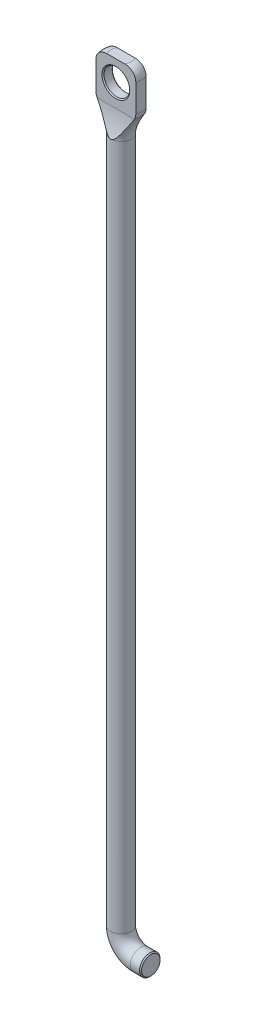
ISO-10303-21;
HEADER;
FILE_DESCRIPTION(('STEP AP214'),'2;1');
FILE_NAME('part.step','',(''),(''),'','','');
FILE_SCHEMA(('AUTOMOTIVE_DESIGN { 1 0 10303 214 1 1 1 1 }'));
ENDSEC;
DATA;
#1=APPLICATION_CONTEXT('core data for automotive mechanical design processes');
#2=APPLICATION_PROTOCOL_DEFINITION('international standard','automotive_design',2000,#1);
#3=PRODUCT_CONTEXT('',#1,'mechanical');
#4=PRODUCT('Part','Part','',(#3));
#5=PRODUCT_RELATED_PRODUCT_CATEGORY('part','',(#4));
#6=PRODUCT_DEFINITION_FORMATION('','',#4);
#7=PRODUCT_DEFINITION_CONTEXT('part definition',#1,'design');
#8=PRODUCT_DEFINITION('design','',#6,#7);
#9=PRODUCT_DEFINITION_SHAPE('','',#8);
#10=(LENGTH_UNIT() NAMED_UNIT(*) SI_UNIT(.MILLI.,.METRE.));
#11=(NAMED_UNIT(*) PLANE_ANGLE_UNIT() SI_UNIT($,.RADIAN.));
#12=(NAMED_UNIT(*) SI_UNIT($,.STERADIAN.) SOLID_ANGLE_UNIT());
#13=UNCERTAINTY_MEASURE_WITH_UNIT(LENGTH_MEASURE(1.E-05),#10,'distance_accuracy_value','');
#14=(GEOMETRIC_REPRESENTATION_CONTEXT(3) GLOBAL_UNCERTAINTY_ASSIGNED_CONTEXT((#13)) GLOBAL_UNIT_ASSIGNED_CONTEXT((#10,
#11,#12)) REPRESENTATION_CONTEXT('',''));
#15=CARTESIAN_POINT('',(0.,0.,0.));
#16=DIRECTION('',(0.,0.,1.));
#17=DIRECTION('',(1.,0.,0.));
#18=AXIS2_PLACEMENT_3D('',#15,#16,#17);
#19=CARTESIAN_POINT('',(-1.87363698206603,68.9134217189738,0.));
#20=CARTESIAN_POINT('',(-1.47402347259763,68.1959274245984,0.));
#21=CARTESIAN_POINT('',(-1.00000000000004,67.4617929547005,0.));
#22=CARTESIAN_POINT('',(-1.00000000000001,66.6,0.));
#23=B_SPLINE_CURVE_WITH_KNOTS('',3,(#19,#20,#21,#22),.UNSPECIFIED.,.F.,.F.,(4,4),(0.,
0.893154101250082),.UNSPECIFIED.);
#24=CARTESIAN_POINT('',(0.,66.6,0.));
#25=DIRECTION('',(0.,-1.,0.));
#26=AXIS1_PLACEMENT('',#24,#25);
#27=SURFACE_OF_REVOLUTION('',#23,#26);
#28=CARTESIAN_POINT('',(0.,68.9134217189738,0.));
#29=DIRECTION('',(0.,-1.,0.));
#30=DIRECTION('',(0.,0.,-1.));
#31=AXIS2_PLACEMENT_3D('',#28,#29,#30);
#32=CIRCLE('',#31,1.87363698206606);
#33=CARTESIAN_POINT('',(1.80568976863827,68.9134217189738,-0.500000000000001));
#34=VERTEX_POINT('',#33);
#35=CARTESIAN_POINT('',(1.80568976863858,68.9134217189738,0.5));
#36=VERTEX_POINT('',#35);
#37=EDGE_CURVE('E139',#34,#36,#32,.T.);
#38=ORIENTED_EDGE('',*,*,#37,.T.);
#39=CARTESIAN_POINT('',(1.80568976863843,68.9134217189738,0.499999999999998));
#40=CARTESIAN_POINT('',(1.77719013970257,68.8657982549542,0.503501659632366));
#41=CARTESIAN_POINT('',(1.74834241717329,68.8184140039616,0.507377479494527));
#42=CARTESIAN_POINT('',(1.69015348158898,68.7240214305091,0.515878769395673));
#43=CARTESIAN_POINT('',(1.66081230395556,68.6770130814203,0.5205041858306));
#44=CARTESIAN_POINT('',(1.60183489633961,68.5832628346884,0.530506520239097));
#45=CARTESIAN_POINT('',(1.57219866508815,68.5365209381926,0.53588344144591));
#46=CARTESIAN_POINT('',(1.51275627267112,68.4431675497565,0.547402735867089));
#47=CARTESIAN_POINT('',(1.4829499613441,68.3965562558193,0.553545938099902));
#48=CARTESIAN_POINT('',(1.42332760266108,68.3034477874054,0.566603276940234));
#49=CARTESIAN_POINT('',(1.39351155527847,68.2569506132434,0.573517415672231));
#50=CARTESIAN_POINT('',(1.3339623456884,68.1640270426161,0.588127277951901));
#51=CARTESIAN_POINT('',(1.30422918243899,68.1176006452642,0.595822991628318));
#52=CARTESIAN_POINT('',(1.23008000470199,68.0016054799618,0.616049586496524));
#53=CARTESIAN_POINT('',(1.18575192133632,67.9320660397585,0.629074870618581));
#54=CARTESIAN_POINT('',(1.09741570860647,67.7931424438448,0.656918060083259));
#55=CARTESIAN_POINT('',(1.05340758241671,67.7237582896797,0.671735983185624));
#56=CARTESIAN_POINT('',(0.965462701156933,67.585451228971,0.703109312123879));
#57=CARTESIAN_POINT('',(0.921525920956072,67.5165278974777,0.719662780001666));
#58=CARTESIAN_POINT('',(0.832997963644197,67.3795207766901,0.754397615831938));
#59=CARTESIAN_POINT('',(0.788406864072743,67.31143688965,0.772578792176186));
#60=CARTESIAN_POINT('',(0.709955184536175,67.1956622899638,0.805029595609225));
#61=CARTESIAN_POINT('',(0.676560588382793,67.1475676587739,0.818980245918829));
#62=CARTESIAN_POINT('',(0.607893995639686,67.052688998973,0.847397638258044));
#63=CARTESIAN_POINT('',(0.572617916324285,67.00590818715,0.86186547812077));
#64=CARTESIAN_POINT('',(0.517057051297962,66.9371021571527,0.88377061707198));
#65=CARTESIAN_POINT('',(0.49788910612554,66.914171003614,0.891181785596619));
#66=CARTESIAN_POINT('',(0.458530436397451,66.8691822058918,0.905925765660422));
#67=CARTESIAN_POINT('',(0.438340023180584,66.8471242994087,0.913258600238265));
#68=CARTESIAN_POINT('',(0.39670144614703,66.8042723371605,0.92768946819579));
#69=CARTESIAN_POINT('',(0.375257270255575,66.7834746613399,0.934788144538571));
#70=CARTESIAN_POINT('',(0.330705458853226,66.7436080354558,0.948554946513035));
#71=CARTESIAN_POINT('',(0.307599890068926,66.7245370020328,0.955223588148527));
#72=CARTESIAN_POINT('',(0.263791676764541,66.6922738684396,0.966618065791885));
#73=CARTESIAN_POINT('',(0.243446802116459,66.6786491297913,0.971474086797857));
#74=CARTESIAN_POINT('',(0.201137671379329,66.6537864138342,0.980395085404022));
#75=CARTESIAN_POINT('',(0.1791728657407,66.6425492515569,0.984459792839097));
#76=CARTESIAN_POINT('',(0.133229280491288,66.6232958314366,0.991457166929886));
#77=CARTESIAN_POINT('',(0.109224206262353,66.6153331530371,0.994370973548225));
#78=CARTESIAN_POINT('',(0.0600190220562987,66.6040840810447,0.998495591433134));
#79=CARTESIAN_POINT('',(0.0348229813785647,66.6007828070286,0.999711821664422));
#80=CARTESIAN_POINT('',(-0.0123457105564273,66.599553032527,1.00016456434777));
#81=CARTESIAN_POINT('',(-0.0343001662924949,66.6009667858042,0.999643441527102));
#82=CARTESIAN_POINT('',(-0.0775749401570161,66.6075272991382,0.997232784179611));
#83=CARTESIAN_POINT('',(-0.0988942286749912,66.6126798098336,0.995341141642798));
#84=CARTESIAN_POINT('',(-0.146686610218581,66.6280879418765,0.989712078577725));
#85=CARTESIAN_POINT('',(-0.172758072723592,66.6394182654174,0.98558852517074));
#86=CARTESIAN_POINT('',(-0.222751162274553,66.6656918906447,0.976111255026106));
#87=CARTESIAN_POINT('',(-0.24666714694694,66.6806443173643,0.970754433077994));
#88=CARTESIAN_POINT('',(-0.299813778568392,66.7180346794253,0.957497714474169));
#89=CARTESIAN_POINT('',(-0.328348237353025,66.7413474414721,0.949328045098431));
#90=CARTESIAN_POINT('',(-0.382953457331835,66.7905281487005,0.932360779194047));
#91=CARTESIAN_POINT('',(-0.409018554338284,66.8164017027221,0.923561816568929));
#92=CARTESIAN_POINT('',(-0.459461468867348,66.869957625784,0.905654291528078));
#93=CARTESIAN_POINT('',(-0.483827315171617,66.8976505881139,0.896544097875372));
#94=CARTESIAN_POINT('',(-0.531163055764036,66.9541322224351,0.878297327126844));
#95=CARTESIAN_POINT('',(-0.55413433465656,66.9829197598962,0.869160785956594));
#96=CARTESIAN_POINT('',(-0.601573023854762,67.044523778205,0.849979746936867));
#97=CARTESIAN_POINT('',(-0.625923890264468,67.0774330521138,0.839946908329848));
#98=CARTESIAN_POINT('',(-0.673770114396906,67.1439408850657,0.820121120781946));
#99=CARTESIAN_POINT('',(-0.697265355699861,67.1775395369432,0.810328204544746));
#100=CARTESIAN_POINT('',(-0.76692538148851,67.2790999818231,0.781419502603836));
#101=CARTESIAN_POINT('',(-0.812233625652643,67.3477846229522,0.76278677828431));
#102=CARTESIAN_POINT('',(-0.901799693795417,67.4857511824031,0.727249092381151));
#103=CARTESIAN_POINT('',(-0.94606165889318,67.5550283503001,0.710335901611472));
#104=CARTESIAN_POINT('',(-1.03452188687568,67.6939993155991,0.67827664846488));
#105=CARTESIAN_POINT('',(-1.07872016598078,67.7636929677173,0.663130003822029));
#106=CARTESIAN_POINT('',(-1.16075276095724,67.8927766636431,0.636784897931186));
#107=CARTESIAN_POINT('',(-1.1985457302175,67.9521418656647,0.625335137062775));
#108=CARTESIAN_POINT('',(-1.27438415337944,68.0709591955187,0.603736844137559));
#109=CARTESIAN_POINT('',(-1.312429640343,68.130411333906,0.593588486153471));
#110=CARTESIAN_POINT('',(-1.38868127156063,68.2494238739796,0.574576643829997));
#111=CARTESIAN_POINT('',(-1.4268874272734,68.3089842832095,0.565713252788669));
#112=CARTESIAN_POINT('',(-1.50346342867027,68.4286213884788,0.549205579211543));
#113=CARTESIAN_POINT('',(-1.54183306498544,68.4886991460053,0.5415680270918));
#114=CARTESIAN_POINT('',(-1.61824339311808,68.60920382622,0.527548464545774));
#115=CARTESIAN_POINT('',(-1.65628411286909,68.6696307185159,0.521166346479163));
#116=CARTESIAN_POINT('',(-1.73163473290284,68.7910484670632,0.509649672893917));
#117=CARTESIAN_POINT('',(-1.76894469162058,68.8520392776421,0.504515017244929));
#118=CARTESIAN_POINT('',(-1.80568976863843,68.9134217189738,0.499999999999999));
#119=B_SPLINE_CURVE_WITH_KNOTS('',3,(#39,#40,#41,#42,#43,#44,#45,#46,#47,#48,#49,#50,#51,#52,
#53,#54,#55,#56,#57,#58,#59,#60,#61,#62,#63,#64,#65,#66,#67,#68,#69,#70,#71,#72,#73,#74,#75,#76,
#77,#78,#79,#80,#81,#82,#83,#84,#85,#86,#87,#88,#89,#90,#91,#92,#93,#94,#95,#96,#97,#98,#99,
#100,#101,#102,#103,#104,#105,#106,#107,#108,#109,#110,#111,#112,#113,#114,#115,#116,#117,#118),
.UNSPECIFIED.,.F.,.F.,(4,2,2,2,2,2,2,2,2,2,2,2,2,2,2,2,2,2,2,2,2,2,2,2,2,2,2,2,2,2,2,2,2,2,2,2,
2,2,2,4),(0.,0.166823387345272,0.333634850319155,0.500447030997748,0.667441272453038,
0.834435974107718,1.00142856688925,1.25187378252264,1.50232147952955,1.75249243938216,
2.00263398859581,2.1831848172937,2.36414477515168,2.45650105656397,2.54882938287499,
2.64087851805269,2.73281506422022,2.8075721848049,2.88235478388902,2.95831652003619,
3.0340352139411,3.09965697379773,3.16537988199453,3.25106691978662,3.33697211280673,
3.44991314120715,3.56310725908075,3.67703169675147,3.79084110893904,3.91727026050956,
4.04371655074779,4.29676928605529,4.54854752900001,4.80024254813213,5.01412937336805,
5.22804477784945,5.44197570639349,5.65704375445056,5.87209335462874,6.08712568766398),.UNSPECIFIED.);
#120=CARTESIAN_POINT('',(0.,66.6,1.));
#121=VERTEX_POINT('',#120);
#122=EDGE_CURVE('E263',#36,#121,#119,.T.);
#123=ORIENTED_EDGE('',*,*,#122,.T.);
#124=CARTESIAN_POINT('',(0.,66.6,0.));
#125=DIRECTION('',(0.,-1.,0.));
#126=DIRECTION('',(0.,0.,-1.));
#127=AXIS2_PLACEMENT_3D('',#124,#125,#126);
#128=CIRCLE('',#127,1.00000000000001);
#129=CARTESIAN_POINT('',(0.,66.6,-1.));
#130=VERTEX_POINT('',#129);
#131=EDGE_CURVE('E143',#130,#121,#128,.T.);
#132=ORIENTED_EDGE('',*,*,#131,.F.);
#133=CARTESIAN_POINT('',(-1.80568976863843,68.9134217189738,-0.499999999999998));
#134=CARTESIAN_POINT('',(-1.77719013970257,68.8657982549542,-0.503501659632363));
#135=CARTESIAN_POINT('',(-1.74834241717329,68.8184140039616,-0.507377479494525));
#136=CARTESIAN_POINT('',(-1.69015348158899,68.7240214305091,-0.515878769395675));
#137=CARTESIAN_POINT('',(-1.66081230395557,68.6770130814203,-0.520504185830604));
#138=CARTESIAN_POINT('',(-1.6018348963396,68.5832628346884,-0.530506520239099));
#139=CARTESIAN_POINT('',(-1.57219866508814,68.5365209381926,-0.535883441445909));
#140=CARTESIAN_POINT('',(-1.5127562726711,68.4431675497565,-0.547402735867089));
#141=CARTESIAN_POINT('',(-1.4829499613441,68.3965562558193,-0.553545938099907));
#142=CARTESIAN_POINT('',(-1.42332760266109,68.3034477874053,-0.56660327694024));
#143=CARTESIAN_POINT('',(-1.39351155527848,68.2569506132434,-0.573517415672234));
#144=CARTESIAN_POINT('',(-1.3339623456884,68.1640270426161,-0.588127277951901));
#145=CARTESIAN_POINT('',(-1.30422918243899,68.1176006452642,-0.595822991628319));
#146=CARTESIAN_POINT('',(-1.23008000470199,68.0016054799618,-0.616049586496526));
#147=CARTESIAN_POINT('',(-1.18575192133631,67.9320660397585,-0.629074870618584));
#148=CARTESIAN_POINT('',(-1.09741570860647,67.7931424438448,-0.656918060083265));
#149=CARTESIAN_POINT('',(-1.05340758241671,67.7237582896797,-0.671735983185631));
#150=CARTESIAN_POINT('',(-0.965462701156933,67.5854512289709,-0.703109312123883));
#151=CARTESIAN_POINT('',(-0.92152592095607,67.5165278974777,-0.719662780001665));
#152=CARTESIAN_POINT('',(-0.832997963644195,67.3795207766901,-0.754397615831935));
#153=CARTESIAN_POINT('',(-0.788406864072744,67.31143688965,-0.772578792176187));
#154=CARTESIAN_POINT('',(-0.709955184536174,67.1956622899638,-0.805029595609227));
#155=CARTESIAN_POINT('',(-0.676560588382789,67.1475676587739,-0.818980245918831));
#156=CARTESIAN_POINT('',(-0.607893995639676,67.052688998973,-0.847397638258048));
#157=CARTESIAN_POINT('',(-0.572617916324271,67.00590818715,-0.861865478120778));
#158=CARTESIAN_POINT('',(-0.517057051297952,66.9371021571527,-0.883770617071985));
#159=CARTESIAN_POINT('',(-0.497889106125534,66.914171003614,-0.891181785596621));
#160=CARTESIAN_POINT('',(-0.458530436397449,66.8691822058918,-0.905925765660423));
#161=CARTESIAN_POINT('',(-0.438340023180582,66.8471242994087,-0.913258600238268));
#162=CARTESIAN_POINT('',(-0.396701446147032,66.8042723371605,-0.927689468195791));
#163=CARTESIAN_POINT('',(-0.375257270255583,66.7834746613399,-0.934788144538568));
#164=CARTESIAN_POINT('',(-0.330705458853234,66.7436080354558,-0.948554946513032));
#165=CARTESIAN_POINT('',(-0.307599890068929,66.7245370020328,-0.955223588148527));
#166=CARTESIAN_POINT('',(-0.263791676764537,66.6922738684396,-0.966618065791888));
#167=CARTESIAN_POINT('',(-0.24344680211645,66.6786491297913,-0.97147408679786));
#168=CARTESIAN_POINT('',(-0.20113767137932,66.6537864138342,-0.980395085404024));
#169=CARTESIAN_POINT('',(-0.179172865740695,66.6425492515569,-0.984459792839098));
#170=CARTESIAN_POINT('',(-0.133229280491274,66.6232958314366,-0.991457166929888));
#171=CARTESIAN_POINT('',(-0.109224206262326,66.6153331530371,-0.994370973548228));
#172=CARTESIAN_POINT('',(-0.0600190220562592,66.6040840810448,-0.998495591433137));
#173=CARTESIAN_POINT('',(-0.0348229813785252,66.6007828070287,-0.999711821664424));
#174=CARTESIAN_POINT('',(0.0123457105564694,66.599553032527,-1.00016456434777));
#175=CARTESIAN_POINT('',(0.0343001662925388,66.6009667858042,-0.9996434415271));
#176=CARTESIAN_POINT('',(0.0775749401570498,66.6075272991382,-0.997232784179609));
#177=CARTESIAN_POINT('',(0.0988942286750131,66.6126798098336,-0.995341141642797));
#178=CARTESIAN_POINT('',(0.146686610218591,66.6280879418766,-0.989712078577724));
#179=CARTESIAN_POINT('',(0.172758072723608,66.6394182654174,-0.985588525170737));
#180=CARTESIAN_POINT('',(0.222751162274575,66.6656918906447,-0.976111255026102));
#181=CARTESIAN_POINT('',(0.246667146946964,66.6806443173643,-0.970754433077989));
#182=CARTESIAN_POINT('',(0.299813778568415,66.7180346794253,-0.957497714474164));
#183=CARTESIAN_POINT('',(0.328348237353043,66.7413474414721,-0.949328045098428));
#184=CARTESIAN_POINT('',(0.382953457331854,66.7905281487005,-0.932360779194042));
#185=CARTESIAN_POINT('',(0.409018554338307,66.8164017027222,-0.923561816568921));
#186=CARTESIAN_POINT('',(0.45946146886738,66.8699576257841,-0.905654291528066));
#187=CARTESIAN_POINT('',(0.483827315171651,66.8976505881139,-0.896544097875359));
#188=CARTESIAN_POINT('',(0.531163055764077,66.9541322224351,-0.878297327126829));
#189=CARTESIAN_POINT('',(0.554134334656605,66.9829197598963,-0.869160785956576));
#190=CARTESIAN_POINT('',(0.60157302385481,67.044523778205,-0.849979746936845));
#191=CARTESIAN_POINT('',(0.625923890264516,67.0774330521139,-0.839946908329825));
#192=CARTESIAN_POINT('',(0.673770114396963,67.1439408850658,-0.820121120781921));
#193=CARTESIAN_POINT('',(0.697265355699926,67.1775395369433,-0.810328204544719));
#194=CARTESIAN_POINT('',(0.766925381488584,67.2790999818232,-0.781419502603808));
#195=CARTESIAN_POINT('',(0.812233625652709,67.3477846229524,-0.762786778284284));
#196=CARTESIAN_POINT('',(0.90179969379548,67.4857511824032,-0.727249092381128));
#197=CARTESIAN_POINT('',(0.946061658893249,67.5550283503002,-0.710335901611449));
#198=CARTESIAN_POINT('',(1.03452188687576,67.6939993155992,-0.678276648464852));
#199=CARTESIAN_POINT('',(1.07872016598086,67.7636929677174,-0.663130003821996));
#200=CARTESIAN_POINT('',(1.16075276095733,67.8927766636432,-0.636784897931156));
#201=CARTESIAN_POINT('',(1.19854573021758,67.9521418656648,-0.625335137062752));
#202=CARTESIAN_POINT('',(1.27438415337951,68.0709591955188,-0.603736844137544));
#203=CARTESIAN_POINT('',(1.31242964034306,68.1304113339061,-0.593588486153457));
#204=CARTESIAN_POINT('',(1.38868127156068,68.2494238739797,-0.574576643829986));
#205=CARTESIAN_POINT('',(1.42688742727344,68.3089842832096,-0.56571325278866));
#206=CARTESIAN_POINT('',(1.50346342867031,68.4286213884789,-0.549205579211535));
#207=CARTESIAN_POINT('',(1.54183306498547,68.4886991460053,-0.541568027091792));
#208=CARTESIAN_POINT('',(1.6182433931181,68.6092038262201,-0.527548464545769));
#209=CARTESIAN_POINT('',(1.65628411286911,68.669630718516,-0.521166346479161));
#210=CARTESIAN_POINT('',(1.73163473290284,68.7910484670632,-0.509649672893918));
#211=CARTESIAN_POINT('',(1.76894469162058,68.8520392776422,-0.50451501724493));
#212=CARTESIAN_POINT('',(1.80568976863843,68.9134217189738,-0.499999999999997));
#213=B_SPLINE_CURVE_WITH_KNOTS('',3,(#133,#134,#135,#136,#137,#138,#139,#140,#141,#142,#143,
#144,#145,#146,#147,#148,#149,#150,#151,#152,#153,#154,#155,#156,#157,#158,#159,#160,#161,#162,
#163,#164,#165,#166,#167,#168,#169,#170,#171,#172,#173,#174,#175,#176,#177,#178,#179,#180,#181,
#182,#183,#184,#185,#186,#187,#188,#189,#190,#191,#192,#193,#194,#195,#196,#197,#198,#199,#200,
#201,#202,#203,#204,#205,#206,#207,#208,#209,#210,#211,#212),.UNSPECIFIED.,.F.,.F.,(4,2,2,2,2,2,
2,2,2,2,2,2,2,2,2,2,2,2,2,2,2,2,2,2,2,2,2,2,2,2,2,2,2,2,2,2,2,2,2,4),(0.,0.16682338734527,
0.333634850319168,0.500447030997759,0.667441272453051,0.834435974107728,1.00142856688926,
1.25187378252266,1.50232147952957,1.75249243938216,2.00263398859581,2.1831848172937,
2.36414477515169,2.45650105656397,2.54882938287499,2.64087851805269,2.73281506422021,
2.80757218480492,2.88235478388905,2.95831652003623,3.03403521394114,3.09965697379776,
3.16537988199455,3.25106691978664,3.33697211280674,3.44991314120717,3.56310725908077,
3.67703169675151,3.79084110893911,3.91727026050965,4.04371655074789,4.29676928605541,
4.54854752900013,4.80024254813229,5.01412937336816,5.22804477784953,5.44197570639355,
5.65704375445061,5.87209335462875,6.08712568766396),.UNSPECIFIED.);
#214=EDGE_CURVE('E152',#130,#34,#213,.T.);
#215=ORIENTED_EDGE('',*,*,#214,.T.);
#216=EDGE_LOOP('',(#38,#123,#132,#215));
#217=FACE_BOUND('',#216,.T.);
#218=ADVANCED_FACE('F31',(#217),#27,.T.);
#219=CARTESIAN_POINT('',(0.,69.4,0.));
#220=DIRECTION('',(0.,-1.,0.));
#221=DIRECTION('',(0.,0.,-1.));
#222=AXIS2_PLACEMENT_3D('',#219,#220,#221);
#223=TOROIDAL_SURFACE('',#222,1.,0.999999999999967);
#224=CARTESIAN_POINT('',(-1.80568976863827,68.9134217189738,0.5));
#225=VERTEX_POINT('',#224);
#226=CARTESIAN_POINT('',(-1.80568976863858,68.9134217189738,-0.500000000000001));
#227=VERTEX_POINT('',#226);
#228=EDGE_CURVE('E138',#225,#227,#32,.T.);
#229=ORIENTED_EDGE('',*,*,#228,.F.);
#230=CARTESIAN_POINT('',(0.,68.5339745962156,0.5));
#231=CARTESIAN_POINT('',(-0.0237460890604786,68.5339740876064,0.5));
#232=CARTESIAN_POINT('',(-0.0474929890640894,68.5329837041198,0.5));
#233=CARTESIAN_POINT('',(-0.0948402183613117,68.5291855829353,0.5));
#234=CARTESIAN_POINT('',(-0.118440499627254,68.5263772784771,0.5));
#235=CARTESIAN_POINT('',(-0.165760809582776,68.5193041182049,0.5));
#236=CARTESIAN_POINT('',(-0.189477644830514,68.5150188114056,0.5));
#237=CARTESIAN_POINT('',(-0.236714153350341,68.5055177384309,0.5));
#238=CARTESIAN_POINT('',(-0.26023384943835,68.500302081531,0.5));
#239=CARTESIAN_POINT('',(-0.309023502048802,68.4889945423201,0.5));
#240=CARTESIAN_POINT('',(-0.334284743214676,68.4828659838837,0.5));
#241=CARTESIAN_POINT('',(-0.384802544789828,68.4705923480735,0.5));
#242=CARTESIAN_POINT('',(-0.410059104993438,68.4644472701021,0.5));
#243=CARTESIAN_POINT('',(-0.485978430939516,68.4466124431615,0.5));
#244=CARTESIAN_POINT('',(-0.536793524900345,68.435522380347,0.5));
#245=CARTESIAN_POINT('',(-0.63858145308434,68.4173398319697,0.5));
#246=CARTESIAN_POINT('',(-0.689545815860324,68.410203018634,0.5));
#247=CARTESIAN_POINT('',(-0.791932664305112,68.4011293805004,0.5));
#248=CARTESIAN_POINT('',(-0.843354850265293,68.3991893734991,0.5));
#249=CARTESIAN_POINT('',(-0.957444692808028,68.4016813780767,0.5));
#250=CARTESIAN_POINT('',(-1.02009406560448,68.4076113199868,0.5));
#251=CARTESIAN_POINT('',(-1.14395265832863,68.4295841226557,0.5));
#252=CARTESIAN_POINT('',(-1.20515335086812,68.4456762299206,0.5));
#253=CARTESIAN_POINT('',(-1.32406245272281,68.4883150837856,0.5));
#254=CARTESIAN_POINT('',(-1.38175875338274,68.5148959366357,0.5));
#255=CARTESIAN_POINT('',(-1.49128866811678,68.5780546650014,0.5));
#256=CARTESIAN_POINT('',(-1.54313271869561,68.6146143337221,0.5));
#257=CARTESIAN_POINT('',(-1.63576784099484,68.6939028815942,0.5));
#258=CARTESIAN_POINT('',(-1.67707602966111,68.7360282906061,0.5));
#259=CARTESIAN_POINT('',(-1.75161396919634,68.8269371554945,0.5));
#260=CARTESIAN_POINT('',(-1.78484245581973,68.8757216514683,0.5));
#261=CARTESIAN_POINT('',(-1.84065563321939,68.9759635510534,0.5));
#262=CARTESIAN_POINT('',(-1.86367620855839,69.0271787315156,0.5));
#263=CARTESIAN_POINT('',(-1.90058539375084,69.1327927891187,0.5));
#264=CARTESIAN_POINT('',(-1.91447644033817,69.1871908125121,0.5));
#265=CARTESIAN_POINT('',(-1.93249420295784,69.2964349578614,0.5));
#266=CARTESIAN_POINT('',(-1.9368145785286,69.3512492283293,0.5));
#267=CARTESIAN_POINT('',(-1.93613116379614,69.4608188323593,0.5));
#268=CARTESIAN_POINT('',(-1.93112778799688,69.5155741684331,0.5));
#269=CARTESIAN_POINT('',(-1.91201219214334,69.6231297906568,0.5));
#270=CARTESIAN_POINT('',(-1.89795466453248,69.6759398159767,0.5));
#271=CARTESIAN_POINT('',(-1.86121680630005,69.7784718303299,0.5));
#272=CARTESIAN_POINT('',(-1.83853578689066,69.8281935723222,0.5));
#273=CARTESIAN_POINT('',(-1.7850994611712,69.9234440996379,0.5));
#274=CARTESIAN_POINT('',(-1.75430078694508,69.9689485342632,0.5));
#275=CARTESIAN_POINT('',(-1.68563896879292,70.0542394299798,0.5));
#276=CARTESIAN_POINT('',(-1.64777787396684,70.0940275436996,0.5));
#277=CARTESIAN_POINT('',(-1.56537093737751,70.1675912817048,0.5));
#278=CARTESIAN_POINT('',(-1.5207167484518,70.2012453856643,0.5));
#279=CARTESIAN_POINT('',(-1.42652094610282,70.2609401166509,0.5));
#280=CARTESIAN_POINT('',(-1.37697338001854,70.2869713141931,0.5));
#281=CARTESIAN_POINT('',(-1.27231718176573,70.3318790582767,0.5));
#282=CARTESIAN_POINT('',(-1.21706343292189,70.3504159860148,0.5));
#283=CARTESIAN_POINT('',(-1.10456309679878,70.3786745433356,0.5));
#284=CARTESIAN_POINT('',(-1.04732373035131,70.388425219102,0.5));
#285=CARTESIAN_POINT('',(-0.949503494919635,70.3979911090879,0.5));
#286=CARTESIAN_POINT('',(-0.909108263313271,70.3999166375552,0.5));
#287=CARTESIAN_POINT('',(-0.828292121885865,70.4000779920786,0.5));
#288=CARTESIAN_POINT('',(-0.787871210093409,70.3983118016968,0.5));
#289=CARTESIAN_POINT('',(-0.706893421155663,70.3915038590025,0.5));
#290=CARTESIAN_POINT('',(-0.666339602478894,70.3864277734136,0.5));
#291=CARTESIAN_POINT('',(-0.585682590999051,70.373644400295,0.5));
#292=CARTESIAN_POINT('',(-0.545579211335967,70.3659382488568,0.5));
#293=CARTESIAN_POINT('',(-0.455022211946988,70.3464906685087,0.5));
#294=CARTESIAN_POINT('',(-0.40468771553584,70.3342213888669,0.5));
#295=CARTESIAN_POINT('',(-0.329151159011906,70.3158962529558,0.5));
#296=CARTESIAN_POINT('',(-0.303954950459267,70.3097982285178,0.5));
#297=CARTESIAN_POINT('',(-0.25342514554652,70.298159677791,0.5));
#298=CARTESIAN_POINT('',(-0.228091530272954,70.292619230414,0.5));
#299=CARTESIAN_POINT('',(-0.17748709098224,70.2827609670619,0.5));
#300=CARTESIAN_POINT('',(-0.152219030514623,70.2784295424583,0.5));
#301=CARTESIAN_POINT('',(-0.101446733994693,70.2715247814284,0.5));
#302=CARTESIAN_POINT('',(-0.0759426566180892,70.2689503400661,0.5));
#303=CARTESIAN_POINT('',(-0.0248978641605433,70.2660186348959,0.5));
#304=CARTESIAN_POINT('',(0.000642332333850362,70.2656528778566,0.5));
#305=CARTESIAN_POINT('',(0.0516535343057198,70.267186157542,0.5));
#306=CARTESIAN_POINT('',(0.0771245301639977,70.2690854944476,0.5));
#307=CARTESIAN_POINT('',(0.135889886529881,70.2757101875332,0.5));
#308=CARTESIAN_POINT('',(0.169100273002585,70.2811413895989,0.5));
#309=CARTESIAN_POINT('',(0.235139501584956,70.293978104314,0.5));
#310=CARTESIAN_POINT('',(0.267967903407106,70.3013856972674,0.5));
#311=CARTESIAN_POINT('',(0.333711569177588,70.3169110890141,0.5));
#312=CARTESIAN_POINT('',(0.366625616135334,70.3250338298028,0.5));
#313=CARTESIAN_POINT('',(0.43252691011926,70.3409076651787,0.5));
#314=CARTESIAN_POINT('',(0.465514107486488,70.3486589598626,0.5));
#315=CARTESIAN_POINT('',(0.532014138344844,70.3630954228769,0.5));
#316=CARTESIAN_POINT('',(0.565529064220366,70.3697713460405,0.5));
#317=CARTESIAN_POINT('',(0.632852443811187,70.3814102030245,0.5));
#318=CARTESIAN_POINT('',(0.66666088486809,70.3863732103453,0.5));
#319=CARTESIAN_POINT('',(0.768227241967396,70.3979843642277,0.5));
#320=CARTESIAN_POINT('',(0.836417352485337,70.401426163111,0.5));
#321=CARTESIAN_POINT('',(0.965281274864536,70.3976644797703,0.5));
#322=CARTESIAN_POINT('',(1.02598267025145,70.3915549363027,0.5));
#323=CARTESIAN_POINT('',(1.14610487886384,70.3698073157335,0.5));
#324=CARTESIAN_POINT('',(1.20551498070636,70.3541083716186,0.5));
#325=CARTESIAN_POINT('',(1.32102729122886,70.3128573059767,0.5));
#326=CARTESIAN_POINT('',(1.37711990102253,70.2872780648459,0.5));
#327=CARTESIAN_POINT('',(1.48377447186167,70.2267238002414,0.5));
#328=CARTESIAN_POINT('',(1.53435343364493,70.1917788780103,0.5));
#329=CARTESIAN_POINT('',(1.62653307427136,70.1148715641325,0.5));
#330=CARTESIAN_POINT('',(1.66840807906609,70.0732381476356,0.5));
#331=CARTESIAN_POINT('',(1.74418561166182,69.9831755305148,0.5));
#332=CARTESIAN_POINT('',(1.77808113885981,69.9347404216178,0.5));
#333=CARTESIAN_POINT('',(1.83523056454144,69.8350692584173,0.5));
#334=CARTESIAN_POINT('',(1.85892083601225,69.7840829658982,0.5));
#335=CARTESIAN_POINT('',(1.89718648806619,69.6788183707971,0.5));
#336=CARTESIAN_POINT('',(1.91176640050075,69.6245417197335,0.5));
#337=CARTESIAN_POINT('',(1.9311447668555,69.5154502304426,0.5));
#338=CARTESIAN_POINT('',(1.93614232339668,69.4606706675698,0.5));
#339=CARTESIAN_POINT('',(1.93680554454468,69.3510513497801,0.5));
#340=CARTESIAN_POINT('',(1.9324708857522,69.2962115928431,0.5));
#341=CARTESIAN_POINT('',(1.91466254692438,69.1884010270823,0.5));
#342=CARTESIAN_POINT('',(1.90124764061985,69.1354204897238,0.5));
#343=CARTESIAN_POINT('',(1.86575518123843,69.0324488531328,0.5));
#344=CARTESIAN_POINT('',(1.84367773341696,68.9824577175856,0.5));
#345=CARTESIAN_POINT('',(1.79140682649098,68.886597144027,0.5));
#346=CARTESIAN_POINT('',(1.7611736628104,68.8407493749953,0.5));
#347=CARTESIAN_POINT('',(1.69356646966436,68.7546749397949,0.5));
#348=CARTESIAN_POINT('',(1.65619267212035,68.7144480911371,0.5));
#349=CARTESIAN_POINT('',(1.57469697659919,68.6399443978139,0.5));
#350=CARTESIAN_POINT('',(1.5304671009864,68.6057858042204,0.5));
#351=CARTESIAN_POINT('',(1.43706290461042,68.5450542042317,0.5));
#352=CARTESIAN_POINT('',(1.38788630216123,68.5184847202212,0.5));
#353=CARTESIAN_POINT('',(1.28397608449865,68.4724760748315,0.5));
#354=CARTESIAN_POINT('',(1.22909948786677,68.4533611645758,0.5));
#355=CARTESIAN_POINT('',(1.11714845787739,68.4238838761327,0.5));
#356=CARTESIAN_POINT('',(1.06007729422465,68.4135089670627,0.5));
#357=CARTESIAN_POINT('',(0.962997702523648,68.4029707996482,0.5));
#358=CARTESIAN_POINT('',(0.923203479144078,68.4006350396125,0.5));
#359=CARTESIAN_POINT('',(0.843551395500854,68.3995919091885,0.5));
#360=CARTESIAN_POINT('',(0.803693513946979,68.4008862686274,0.5));
#361=CARTESIAN_POINT('',(0.723912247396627,68.4067137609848,0.5));
#362=CARTESIAN_POINT('',(0.683990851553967,68.4112725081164,0.5));
#363=CARTESIAN_POINT('',(0.604580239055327,68.4230478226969,0.5));
#364=CARTESIAN_POINT('',(0.565090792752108,68.4302628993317,0.5));
#365=CARTESIAN_POINT('',(0.481701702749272,68.447511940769,0.5));
#366=CARTESIAN_POINT('',(0.437853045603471,68.4577826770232,0.5));
#367=CARTESIAN_POINT('',(0.350238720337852,68.4789431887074,0.5));
#368=CARTESIAN_POINT('',(0.306473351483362,68.489834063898,0.5));
#369=CARTESIAN_POINT('',(0.219237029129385,68.5094183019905,0.5));
#370=CARTESIAN_POINT('',(0.175775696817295,68.5181487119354,0.5));
#371=CARTESIAN_POINT('',(0.110081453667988,68.5273914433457,0.5));
#372=CARTESIAN_POINT('',(0.0881354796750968,68.5298293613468,0.5));
#373=CARTESIAN_POINT('',(0.0441265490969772,68.5331209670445,0.5));
#374=CARTESIAN_POINT('',(0.0220636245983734,68.5339750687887,0.5));
#375=CARTESIAN_POINT('',(0.,68.5339745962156,0.5));
#376=B_SPLINE_CURVE_WITH_KNOTS('',3,(#230,#231,#232,#233,#234,#235,#236,#237,#238,#239,#240,
#241,#242,#243,#244,#245,#246,#247,#248,#249,#250,#251,#252,#253,#254,#255,#256,#257,#258,#259,
#260,#261,#262,#263,#264,#265,#266,#267,#268,#269,#270,#271,#272,#273,#274,#275,#276,#277,#278,
#279,#280,#281,#282,#283,#284,#285,#286,#287,#288,#289,#290,#291,#292,#293,#294,#295,#296,#297,
#298,#299,#300,#301,#302,#303,#304,#305,#306,#307,#308,#309,#310,#311,#312,#313,#314,#315,#316,
#317,#318,#319,#320,#321,#322,#323,#324,#325,#326,#327,#328,#329,#330,#331,#332,#333,#334,#335,
#336,#337,#338,#339,#340,#341,#342,#343,#344,#345,#346,#347,#348,#349,#350,#351,#352,#353,#354,
#355,#356,#357,#358,#359,#360,#361,#362,#363,#364,#365,#366,#367,#368,#369,#370,#371,#372,#373,
#374,#375),.UNSPECIFIED.,.T.,.F.,(4,2,2,2,2,2,2,2,2,2,2,2,2,2,2,2,2,2,2,2,2,2,2,2,2,2,2,2,2,2,2,
2,2,2,2,2,2,2,2,2,2,2,2,2,2,2,2,2,2,2,2,2,2,2,2,2,2,2,2,2,2,2,2,2,2,2,2,2,2,2,2,2,4),(0.,
0.0712215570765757,0.142465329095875,0.21473806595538,0.287002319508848,0.364982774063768,
0.442966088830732,0.598924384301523,0.753096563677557,0.907174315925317,1.09519586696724,
1.28413564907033,1.47369493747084,1.6629106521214,1.83900754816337,2.01513198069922,
2.18276600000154,2.35035525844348,2.51452117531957,2.67867979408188,2.84185598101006,
3.00504520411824,3.16912457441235,3.33315641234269,3.5001497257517,3.66734874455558,
3.84144824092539,4.0149700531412,4.13612662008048,4.25734938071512,4.37985001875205,
4.50229780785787,4.65769950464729,4.73547166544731,4.8132548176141,4.89012347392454,
4.96694374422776,5.0434684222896,5.12000324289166,5.2208402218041,5.32178376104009,
5.42348979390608,5.52514040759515,5.6276230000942,5.73010119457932,5.93416350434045,
6.11650853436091,6.30002317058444,6.48404514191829,6.66748261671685,6.84372572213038,
7.02012287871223,7.1879651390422,7.35572384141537,7.51995738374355,7.68419661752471,
7.84738281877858,8.01056703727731,8.17456049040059,8.33854861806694,8.50544674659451,
8.67242221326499,8.84601397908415,9.01935643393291,9.13878247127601,9.25826542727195,
9.37869633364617,9.4990597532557,9.63413670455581,9.76946115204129,9.90227300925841,
9.9684656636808,10.03464101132),.UNSPECIFIED.);
#377=CARTESIAN_POINT('',(-1.93649167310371,69.4,0.499999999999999));
#378=VERTEX_POINT('',#377);
#379=EDGE_CURVE('E231',#225,#378,#376,.T.);
#380=ORIENTED_EDGE('',*,*,#379,.T.);
#381=CARTESIAN_POINT('',(0.,69.4,0.));
#382=DIRECTION('',(0.,-1.,0.));
#383=DIRECTION('',(0.,0.,-1.));
#384=AXIS2_PLACEMENT_3D('',#381,#382,#383);
#385=CIRCLE('',#384,2.);
#386=CARTESIAN_POINT('',(-1.93649167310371,69.4,-0.499999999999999));
#387=VERTEX_POINT('',#386);
#388=EDGE_CURVE('E134',#378,#387,#385,.T.);
#389=ORIENTED_EDGE('',*,*,#388,.T.);
#390=CARTESIAN_POINT('',(0.,68.5339745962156,-0.5));
#391=CARTESIAN_POINT('',(0.0237460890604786,68.5339740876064,-0.5));
#392=CARTESIAN_POINT('',(0.0474929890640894,68.5329837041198,-0.5));
#393=CARTESIAN_POINT('',(0.0948402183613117,68.5291855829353,-0.5));
#394=CARTESIAN_POINT('',(0.118440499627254,68.5263772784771,-0.5));
#395=CARTESIAN_POINT('',(0.165760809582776,68.5193041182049,-0.5));
#396=CARTESIAN_POINT('',(0.189477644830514,68.5150188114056,-0.5));
#397=CARTESIAN_POINT('',(0.236714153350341,68.5055177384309,-0.5));
#398=CARTESIAN_POINT('',(0.26023384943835,68.500302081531,-0.5));
#399=CARTESIAN_POINT('',(0.309023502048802,68.4889945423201,-0.5));
#400=CARTESIAN_POINT('',(0.334284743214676,68.4828659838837,-0.5));
#401=CARTESIAN_POINT('',(0.384802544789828,68.4705923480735,-0.5));
#402=CARTESIAN_POINT('',(0.410059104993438,68.4644472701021,-0.5));
#403=CARTESIAN_POINT('',(0.485978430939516,68.4466124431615,-0.5));
#404=CARTESIAN_POINT('',(0.536793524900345,68.435522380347,-0.5));
#405=CARTESIAN_POINT('',(0.63858145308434,68.4173398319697,-0.5));
#406=CARTESIAN_POINT('',(0.689545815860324,68.410203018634,-0.5));
#407=CARTESIAN_POINT('',(0.791932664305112,68.4011293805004,-0.5));
#408=CARTESIAN_POINT('',(0.843354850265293,68.3991893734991,-0.5));
#409=CARTESIAN_POINT('',(0.957444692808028,68.4016813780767,-0.5));
#410=CARTESIAN_POINT('',(1.02009406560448,68.4076113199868,-0.5));
#411=CARTESIAN_POINT('',(1.14395265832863,68.4295841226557,-0.5));
#412=CARTESIAN_POINT('',(1.20515335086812,68.4456762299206,-0.5));
#413=CARTESIAN_POINT('',(1.32406245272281,68.4883150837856,-0.5));
#414=CARTESIAN_POINT('',(1.38175875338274,68.5148959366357,-0.5));
#415=CARTESIAN_POINT('',(1.49128866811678,68.5780546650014,-0.5));
#416=CARTESIAN_POINT('',(1.54313271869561,68.6146143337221,-0.5));
#417=CARTESIAN_POINT('',(1.63576784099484,68.6939028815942,-0.5));
#418=CARTESIAN_POINT('',(1.67707602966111,68.7360282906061,-0.5));
#419=CARTESIAN_POINT('',(1.75161396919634,68.8269371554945,-0.5));
#420=CARTESIAN_POINT('',(1.78484245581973,68.8757216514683,-0.5));
#421=CARTESIAN_POINT('',(1.84065563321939,68.9759635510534,-0.5));
#422=CARTESIAN_POINT('',(1.86367620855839,69.0271787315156,-0.5));
#423=CARTESIAN_POINT('',(1.90058539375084,69.1327927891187,-0.5));
#424=CARTESIAN_POINT('',(1.91447644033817,69.1871908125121,-0.5));
#425=CARTESIAN_POINT('',(1.93249420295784,69.2964349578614,-0.5));
#426=CARTESIAN_POINT('',(1.9368145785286,69.3512492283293,-0.5));
#427=CARTESIAN_POINT('',(1.93613116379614,69.4608188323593,-0.5));
#428=CARTESIAN_POINT('',(1.93112778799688,69.5155741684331,-0.5));
#429=CARTESIAN_POINT('',(1.91201219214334,69.6231297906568,-0.5));
#430=CARTESIAN_POINT('',(1.89795466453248,69.6759398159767,-0.5));
#431=CARTESIAN_POINT('',(1.86121680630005,69.7784718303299,-0.5));
#432=CARTESIAN_POINT('',(1.83853578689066,69.8281935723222,-0.5));
#433=CARTESIAN_POINT('',(1.7850994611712,69.9234440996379,-0.5));
#434=CARTESIAN_POINT('',(1.75430078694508,69.9689485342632,-0.5));
#435=CARTESIAN_POINT('',(1.68563896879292,70.0542394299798,-0.5));
#436=CARTESIAN_POINT('',(1.64777787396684,70.0940275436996,-0.5));
#437=CARTESIAN_POINT('',(1.56537093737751,70.1675912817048,-0.5));
#438=CARTESIAN_POINT('',(1.5207167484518,70.2012453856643,-0.5));
#439=CARTESIAN_POINT('',(1.42652094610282,70.2609401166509,-0.5));
#440=CARTESIAN_POINT('',(1.37697338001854,70.2869713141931,-0.5));
#441=CARTESIAN_POINT('',(1.27231718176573,70.3318790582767,-0.5));
#442=CARTESIAN_POINT('',(1.21706343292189,70.3504159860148,-0.5));
#443=CARTESIAN_POINT('',(1.10456309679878,70.3786745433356,-0.5));
#444=CARTESIAN_POINT('',(1.04732373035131,70.388425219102,-0.5));
#445=CARTESIAN_POINT('',(0.949503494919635,70.3979911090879,-0.5));
#446=CARTESIAN_POINT('',(0.909108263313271,70.3999166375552,-0.5));
#447=CARTESIAN_POINT('',(0.828292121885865,70.4000779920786,-0.5));
#448=CARTESIAN_POINT('',(0.787871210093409,70.3983118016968,-0.5));
#449=CARTESIAN_POINT('',(0.706893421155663,70.3915038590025,-0.5));
#450=CARTESIAN_POINT('',(0.666339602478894,70.3864277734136,-0.5));
#451=CARTESIAN_POINT('',(0.585682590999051,70.373644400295,-0.5));
#452=CARTESIAN_POINT('',(0.545579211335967,70.3659382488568,-0.5));
#453=CARTESIAN_POINT('',(0.455022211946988,70.3464906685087,-0.5));
#454=CARTESIAN_POINT('',(0.40468771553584,70.3342213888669,-0.5));
#455=CARTESIAN_POINT('',(0.329151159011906,70.3158962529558,-0.5));
#456=CARTESIAN_POINT('',(0.303954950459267,70.3097982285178,-0.5));
#457=CARTESIAN_POINT('',(0.25342514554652,70.298159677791,-0.5));
#458=CARTESIAN_POINT('',(0.228091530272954,70.292619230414,-0.5));
#459=CARTESIAN_POINT('',(0.17748709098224,70.2827609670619,-0.5));
#460=CARTESIAN_POINT('',(0.152219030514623,70.2784295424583,-0.5));
#461=CARTESIAN_POINT('',(0.101446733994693,70.2715247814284,-0.5));
#462=CARTESIAN_POINT('',(0.0759426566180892,70.2689503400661,-0.5));
#463=CARTESIAN_POINT('',(0.0248978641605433,70.2660186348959,-0.5));
#464=CARTESIAN_POINT('',(-0.000642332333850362,70.2656528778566,-0.5));
#465=CARTESIAN_POINT('',(-0.0516535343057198,70.267186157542,-0.5));
#466=CARTESIAN_POINT('',(-0.0771245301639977,70.2690854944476,-0.5));
#467=CARTESIAN_POINT('',(-0.135889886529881,70.2757101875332,-0.5));
#468=CARTESIAN_POINT('',(-0.169100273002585,70.2811413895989,-0.5));
#469=CARTESIAN_POINT('',(-0.235139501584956,70.293978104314,-0.5));
#470=CARTESIAN_POINT('',(-0.267967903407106,70.3013856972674,-0.5));
#471=CARTESIAN_POINT('',(-0.333711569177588,70.3169110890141,-0.5));
#472=CARTESIAN_POINT('',(-0.366625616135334,70.3250338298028,-0.5));
#473=CARTESIAN_POINT('',(-0.43252691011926,70.3409076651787,-0.5));
#474=CARTESIAN_POINT('',(-0.465514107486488,70.3486589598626,-0.5));
#475=CARTESIAN_POINT('',(-0.532014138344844,70.3630954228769,-0.5));
#476=CARTESIAN_POINT('',(-0.565529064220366,70.3697713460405,-0.5));
#477=CARTESIAN_POINT('',(-0.632852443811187,70.3814102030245,-0.5));
#478=CARTESIAN_POINT('',(-0.66666088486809,70.3863732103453,-0.5));
#479=CARTESIAN_POINT('',(-0.768227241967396,70.3979843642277,-0.5));
#480=CARTESIAN_POINT('',(-0.836417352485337,70.401426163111,-0.5));
#481=CARTESIAN_POINT('',(-0.965281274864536,70.3976644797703,-0.5));
#482=CARTESIAN_POINT('',(-1.02598267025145,70.3915549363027,-0.5));
#483=CARTESIAN_POINT('',(-1.14610487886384,70.3698073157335,-0.5));
#484=CARTESIAN_POINT('',(-1.20551498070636,70.3541083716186,-0.5));
#485=CARTESIAN_POINT('',(-1.32102729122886,70.3128573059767,-0.5));
#486=CARTESIAN_POINT('',(-1.37711990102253,70.2872780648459,-0.5));
#487=CARTESIAN_POINT('',(-1.48377447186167,70.2267238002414,-0.5));
#488=CARTESIAN_POINT('',(-1.53435343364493,70.1917788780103,-0.5));
#489=CARTESIAN_POINT('',(-1.62653307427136,70.1148715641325,-0.5));
#490=CARTESIAN_POINT('',(-1.66840807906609,70.0732381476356,-0.5));
#491=CARTESIAN_POINT('',(-1.74418561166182,69.9831755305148,-0.5));
#492=CARTESIAN_POINT('',(-1.77808113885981,69.9347404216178,-0.5));
#493=CARTESIAN_POINT('',(-1.83523056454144,69.8350692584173,-0.5));
#494=CARTESIAN_POINT('',(-1.85892083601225,69.7840829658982,-0.5));
#495=CARTESIAN_POINT('',(-1.89718648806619,69.6788183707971,-0.5));
#496=CARTESIAN_POINT('',(-1.91176640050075,69.6245417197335,-0.5));
#497=CARTESIAN_POINT('',(-1.9311447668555,69.5154502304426,-0.5));
#498=CARTESIAN_POINT('',(-1.93614232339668,69.4606706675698,-0.5));
#499=CARTESIAN_POINT('',(-1.93680554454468,69.3510513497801,-0.5));
#500=CARTESIAN_POINT('',(-1.9324708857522,69.2962115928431,-0.5));
#501=CARTESIAN_POINT('',(-1.91466254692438,69.1884010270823,-0.5));
#502=CARTESIAN_POINT('',(-1.90124764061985,69.1354204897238,-0.5));
#503=CARTESIAN_POINT('',(-1.86575518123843,69.0324488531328,-0.5));
#504=CARTESIAN_POINT('',(-1.84367773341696,68.9824577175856,-0.5));
#505=CARTESIAN_POINT('',(-1.79140682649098,68.886597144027,-0.5));
#506=CARTESIAN_POINT('',(-1.7611736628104,68.8407493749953,-0.5));
#507=CARTESIAN_POINT('',(-1.69356646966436,68.7546749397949,-0.5));
#508=CARTESIAN_POINT('',(-1.65619267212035,68.7144480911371,-0.5));
#509=CARTESIAN_POINT('',(-1.57469697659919,68.6399443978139,-0.5));
#510=CARTESIAN_POINT('',(-1.5304671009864,68.6057858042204,-0.5));
#511=CARTESIAN_POINT('',(-1.43706290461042,68.5450542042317,-0.5));
#512=CARTESIAN_POINT('',(-1.38788630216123,68.5184847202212,-0.5));
#513=CARTESIAN_POINT('',(-1.28397608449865,68.4724760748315,-0.5));
#514=CARTESIAN_POINT('',(-1.22909948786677,68.4533611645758,-0.5));
#515=CARTESIAN_POINT('',(-1.11714845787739,68.4238838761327,-0.5));
#516=CARTESIAN_POINT('',(-1.06007729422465,68.4135089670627,-0.5));
#517=CARTESIAN_POINT('',(-0.962997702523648,68.4029707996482,-0.5));
#518=CARTESIAN_POINT('',(-0.923203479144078,68.4006350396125,-0.5));
#519=CARTESIAN_POINT('',(-0.843551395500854,68.3995919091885,-0.5));
#520=CARTESIAN_POINT('',(-0.803693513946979,68.4008862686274,-0.5));
#521=CARTESIAN_POINT('',(-0.723912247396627,68.4067137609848,-0.5));
#522=CARTESIAN_POINT('',(-0.683990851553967,68.4112725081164,-0.5));
#523=CARTESIAN_POINT('',(-0.604580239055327,68.4230478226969,-0.5));
#524=CARTESIAN_POINT('',(-0.565090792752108,68.4302628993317,-0.5));
#525=CARTESIAN_POINT('',(-0.481701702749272,68.447511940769,-0.5));
#526=CARTESIAN_POINT('',(-0.437853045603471,68.4577826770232,-0.5));
#527=CARTESIAN_POINT('',(-0.350238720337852,68.4789431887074,-0.5));
#528=CARTESIAN_POINT('',(-0.306473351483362,68.489834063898,-0.5));
#529=CARTESIAN_POINT('',(-0.219237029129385,68.5094183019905,-0.5));
#530=CARTESIAN_POINT('',(-0.175775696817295,68.5181487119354,-0.5));
#531=CARTESIAN_POINT('',(-0.110081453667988,68.5273914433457,-0.5));
#532=CARTESIAN_POINT('',(-0.0881354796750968,68.5298293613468,-0.5));
#533=CARTESIAN_POINT('',(-0.0441265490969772,68.5331209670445,-0.5));
#534=CARTESIAN_POINT('',(-0.0220636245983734,68.5339750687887,-0.5));
#535=CARTESIAN_POINT('',(0.,68.5339745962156,-0.5));
#536=B_SPLINE_CURVE_WITH_KNOTS('',3,(#390,#391,#392,#393,#394,#395,#396,#397,#398,#399,#400,
#401,#402,#403,#404,#405,#406,#407,#408,#409,#410,#411,#412,#413,#414,#415,#416,#417,#418,#419,
#420,#421,#422,#423,#424,#425,#426,#427,#428,#429,#430,#431,#432,#433,#434,#435,#436,#437,#438,
#439,#440,#441,#442,#443,#444,#445,#446,#447,#448,#449,#450,#451,#452,#453,#454,#455,#456,#457,
#458,#459,#460,#461,#462,#463,#464,#465,#466,#467,#468,#469,#470,#471,#472,#473,#474,#475,#476,
#477,#478,#479,#480,#481,#482,#483,#484,#485,#486,#487,#488,#489,#490,#491,#492,#493,#494,#495,
#496,#497,#498,#499,#500,#501,#502,#503,#504,#505,#506,#507,#508,#509,#510,#511,#512,#513,#514,
#515,#516,#517,#518,#519,#520,#521,#522,#523,#524,#525,#526,#527,#528,#529,#530,#531,#532,#533,
#534,#535),.UNSPECIFIED.,.T.,.F.,(4,2,2,2,2,2,2,2,2,2,2,2,2,2,2,2,2,2,2,2,2,2,2,2,2,2,2,2,2,2,2,
2,2,2,2,2,2,2,2,2,2,2,2,2,2,2,2,2,2,2,2,2,2,2,2,2,2,2,2,2,2,2,2,2,2,2,2,2,2,2,2,2,4),(0.,
0.0712215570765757,0.142465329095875,0.21473806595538,0.287002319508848,0.364982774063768,
0.442966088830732,0.598924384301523,0.753096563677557,0.907174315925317,1.09519586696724,
1.28413564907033,1.47369493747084,1.6629106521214,1.83900754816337,2.01513198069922,
2.18276600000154,2.35035525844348,2.51452117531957,2.67867979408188,2.84185598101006,
3.00504520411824,3.16912457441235,3.33315641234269,3.5001497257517,3.66734874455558,
3.84144824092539,4.0149700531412,4.13612662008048,4.25734938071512,4.37985001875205,
4.50229780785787,4.65769950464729,4.73547166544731,4.8132548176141,4.89012347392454,
4.96694374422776,5.0434684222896,5.12000324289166,5.2208402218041,5.32178376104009,
5.42348979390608,5.52514040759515,5.6276230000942,5.73010119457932,5.93416350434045,
6.11650853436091,6.30002317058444,6.48404514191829,6.66748261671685,6.84372572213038,
7.02012287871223,7.1879651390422,7.35572384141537,7.51995738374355,7.68419661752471,
7.84738281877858,8.01056703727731,8.17456049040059,8.33854861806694,8.50544674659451,
8.67242221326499,8.84601397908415,9.01935643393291,9.13878247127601,9.25826542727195,
9.37869633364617,9.4990597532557,9.63413670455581,9.76946115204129,9.90227300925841,
9.9684656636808,10.03464101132),.UNSPECIFIED.);
#537=EDGE_CURVE('E220',#387,#227,#536,.T.);
#538=ORIENTED_EDGE('',*,*,#537,.T.);
#539=EDGE_LOOP('',(#229,#380,#389,#538));
#540=FACE_BOUND('',#539,.T.);
#541=ADVANCED_FACE('F240',(#540),#223,.T.);
#542=CARTESIAN_POINT('',(0.,66.6,0.));
#543=DIRECTION('',(0.,-1.,0.));
#544=DIRECTION('',(0.,0.,-1.));
#545=AXIS2_PLACEMENT_3D('',#542,#543,#544);
#546=CYLINDRICAL_SURFACE('',#545,2.);
#547=CARTESIAN_POINT('',(0.,72.1,0.));
#548=DIRECTION('',(0.,-1.,0.));
#549=DIRECTION('',(0.,0.,-1.));
#550=AXIS2_PLACEMENT_3D('',#547,#548,#549);
#551=CIRCLE('',#550,2.);
#552=CARTESIAN_POINT('',(1.93649167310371,72.1,-0.5));
#553=VERTEX_POINT('',#552);
#554=CARTESIAN_POINT('',(1.93649167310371,72.1,0.5));
#555=VERTEX_POINT('',#554);
#556=EDGE_CURVE('E117',#553,#555,#551,.T.);
#557=ORIENTED_EDGE('',*,*,#556,.T.);
#558=DIRECTION('',(0.,-1.,0.));
#559=VECTOR('',#558,1.);
#560=CARTESIAN_POINT('',(1.93649167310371,66.6,0.499999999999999));
#561=LINE('',#560,#559);
#562=CARTESIAN_POINT('',(1.93649167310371,69.4,0.499999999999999));
#563=VERTEX_POINT('',#562);
#564=EDGE_CURVE('E235',#555,#563,#561,.T.);
#565=ORIENTED_EDGE('',*,*,#564,.T.);
#566=CARTESIAN_POINT('',(1.93649167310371,69.4,-0.499999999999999));
#567=VERTEX_POINT('',#566);
#568=EDGE_CURVE('E135',#567,#563,#385,.T.);
#569=ORIENTED_EDGE('',*,*,#568,.F.);
#570=DIRECTION('',(0.,-1.,0.));
#571=VECTOR('',#570,1.);
#572=CARTESIAN_POINT('',(1.93649167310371,66.6,-0.499999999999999));
#573=LINE('',#572,#571);
#574=EDGE_CURVE('E118',#567,#553,#573,.F.);
#575=ORIENTED_EDGE('',*,*,#574,.T.);
#576=EDGE_LOOP('',(#557,#565,#569,#575));
#577=FACE_BOUND('',#576,.T.);
#578=ADVANCED_FACE('F277',(#577),#546,.T.);
#579=CARTESIAN_POINT('',(0.,72.1,0.));
#580=DIRECTION('',(0.,-1.,0.));
#581=DIRECTION('',(0.,0.,-1.));
#582=AXIS2_PLACEMENT_3D('',#579,#580,#581);
#583=DEGENERATE_TOROIDAL_SURFACE('',#582,1.,1.,.T.);
#584=CARTESIAN_POINT('',(0.,73.1,0.));
#585=DIRECTION('',(0.,-1.,0.));
#586=DIRECTION('',(0.,0.,-1.));
#587=AXIS2_PLACEMENT_3D('',#584,#585,#586);
#588=CIRCLE('',#587,0.999999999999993);
#589=CARTESIAN_POINT('',(0.866025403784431,73.1,-0.5));
#590=VERTEX_POINT('',#589);
#591=CARTESIAN_POINT('',(0.866025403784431,73.1,0.5));
#592=VERTEX_POINT('',#591);
#593=EDGE_CURVE('E115',#590,#592,#588,.T.);
#594=ORIENTED_EDGE('',*,*,#593,.T.);
#595=CARTESIAN_POINT('',(0.,72.9660254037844,0.5));
#596=CARTESIAN_POINT('',(0.0237460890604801,72.9660259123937,0.5));
#597=CARTESIAN_POINT('',(0.0474929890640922,72.9670162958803,0.5));
#598=CARTESIAN_POINT('',(0.0948402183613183,72.9708144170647,0.5));
#599=CARTESIAN_POINT('',(0.118440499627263,72.9736227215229,0.5));
#600=CARTESIAN_POINT('',(0.165760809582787,72.9806958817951,0.5));
#601=CARTESIAN_POINT('',(0.189477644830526,72.9849811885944,0.5));
#602=CARTESIAN_POINT('',(0.236714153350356,72.9944822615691,0.5));
#603=CARTESIAN_POINT('',(0.260233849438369,72.999697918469,0.5));
#604=CARTESIAN_POINT('',(0.309023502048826,73.0110054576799,0.5));
#605=CARTESIAN_POINT('',(0.334284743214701,73.0171340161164,0.5));
#606=CARTESIAN_POINT('',(0.384802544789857,73.0294076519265,0.5));
#607=CARTESIAN_POINT('',(0.410059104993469,73.0355527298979,0.5));
#608=CARTESIAN_POINT('',(0.485978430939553,73.0533875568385,0.5));
#609=CARTESIAN_POINT('',(0.536793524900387,73.064477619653,0.5));
#610=CARTESIAN_POINT('',(0.638581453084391,73.0826601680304,0.5));
#611=CARTESIAN_POINT('',(0.68954581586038,73.089796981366,0.5));
#612=CARTESIAN_POINT('',(0.791932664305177,73.0988706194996,0.5));
#613=CARTESIAN_POINT('',(0.843354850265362,73.100810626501,0.5));
#614=CARTESIAN_POINT('',(0.9574446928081,73.0983186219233,0.5));
#615=CARTESIAN_POINT('',(1.02009406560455,73.0923886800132,0.5));
#616=CARTESIAN_POINT('',(1.1439526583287,73.0704158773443,0.5));
#617=CARTESIAN_POINT('',(1.20515335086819,73.0543237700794,0.5));
#618=CARTESIAN_POINT('',(1.32406245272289,73.0116849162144,0.5));
#619=CARTESIAN_POINT('',(1.38175875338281,72.9851040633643,0.5));
#620=CARTESIAN_POINT('',(1.49128866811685,72.9219453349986,0.5));
#621=CARTESIAN_POINT('',(1.54313271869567,72.8853856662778,0.5));
#622=CARTESIAN_POINT('',(1.6357678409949,72.8060971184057,0.5));
#623=CARTESIAN_POINT('',(1.67707602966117,72.7639717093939,0.5));
#624=CARTESIAN_POINT('',(1.7516139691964,72.6730628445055,0.5));
#625=CARTESIAN_POINT('',(1.78484245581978,72.6242783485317,0.5));
#626=CARTESIAN_POINT('',(1.84065563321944,72.5240364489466,0.5));
#627=CARTESIAN_POINT('',(1.86367620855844,72.4728212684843,0.5));
#628=CARTESIAN_POINT('',(1.90058539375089,72.3672072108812,0.5));
#629=CARTESIAN_POINT('',(1.91447644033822,72.3128091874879,0.5));
#630=CARTESIAN_POINT('',(1.93249420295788,72.2035650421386,0.5));
#631=CARTESIAN_POINT('',(1.93681457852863,72.1487507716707,0.5));
#632=CARTESIAN_POINT('',(1.93613116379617,72.0391811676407,0.5));
#633=CARTESIAN_POINT('',(1.93112778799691,71.9844258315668,0.5));
#634=CARTESIAN_POINT('',(1.91201219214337,71.8768702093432,0.5));
#635=CARTESIAN_POINT('',(1.8979546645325,71.8240601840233,0.5));
#636=CARTESIAN_POINT('',(1.86121680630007,71.7215281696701,0.5));
#637=CARTESIAN_POINT('',(1.83853578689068,71.6718064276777,0.5));
#638=CARTESIAN_POINT('',(1.78509946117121,71.576555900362,0.5));
#639=CARTESIAN_POINT('',(1.75430078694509,71.5310514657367,0.5));
#640=CARTESIAN_POINT('',(1.68563896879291,71.4457605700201,0.5));
#641=CARTESIAN_POINT('',(1.64777787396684,71.4059724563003,0.5));
#642=CARTESIAN_POINT('',(1.5653709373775,71.3324087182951,0.5));
#643=CARTESIAN_POINT('',(1.52071674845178,71.2987546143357,0.5));
#644=CARTESIAN_POINT('',(1.4265209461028,71.2390598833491,0.5));
#645=CARTESIAN_POINT('',(1.37697338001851,71.2130286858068,0.5));
#646=CARTESIAN_POINT('',(1.27231718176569,71.1681209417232,0.5));
#647=CARTESIAN_POINT('',(1.21706343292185,71.1495840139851,0.5));
#648=CARTESIAN_POINT('',(1.10456309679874,71.1213254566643,0.5));
#649=CARTESIAN_POINT('',(1.04732373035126,71.111574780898,0.5));
#650=CARTESIAN_POINT('',(0.949503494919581,71.1020088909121,0.5));
#651=CARTESIAN_POINT('',(0.909108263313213,71.1000833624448,0.5));
#652=CARTESIAN_POINT('',(0.828292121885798,71.0999220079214,0.5));
#653=CARTESIAN_POINT('',(0.787871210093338,71.1016881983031,0.5));
#654=CARTESIAN_POINT('',(0.706893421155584,71.1084961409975,0.5));
#655=CARTESIAN_POINT('',(0.666339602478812,71.1135722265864,0.5));
#656=CARTESIAN_POINT('',(0.585682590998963,71.126355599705,0.5));
#657=CARTESIAN_POINT('',(0.545579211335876,71.1340617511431,0.5));
#658=CARTESIAN_POINT('',(0.455022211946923,71.1535093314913,0.5));
#659=CARTESIAN_POINT('',(0.404687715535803,71.165778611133,0.5));
#660=CARTESIAN_POINT('',(0.329151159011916,71.1841037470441,0.5));
#661=CARTESIAN_POINT('',(0.303954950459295,71.1902017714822,0.5));
#662=CARTESIAN_POINT('',(0.25342514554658,71.201840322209,0.5));
#663=CARTESIAN_POINT('',(0.22809153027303,71.2073807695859,0.5));
#664=CARTESIAN_POINT('',(0.177487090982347,71.217239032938,0.5));
#665=CARTESIAN_POINT('',(0.152219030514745,71.2215704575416,0.5));
#666=CARTESIAN_POINT('',(0.101446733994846,71.2284752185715,0.5));
#667=CARTESIAN_POINT('',(0.0759426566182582,71.2310496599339,0.5));
#668=CARTESIAN_POINT('',(0.0248978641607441,71.2339813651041,0.5));
#669=CARTESIAN_POINT('',(-0.000642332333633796,71.2343471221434,0.5));
#670=CARTESIAN_POINT('',(-0.0516535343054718,71.232813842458,0.5));
#671=CARTESIAN_POINT('',(-0.077124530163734,71.2309145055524,0.5));
#672=CARTESIAN_POINT('',(-0.135889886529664,71.2242898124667,0.5));
#673=CARTESIAN_POINT('',(-0.16910027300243,71.2188586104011,0.5));
#674=CARTESIAN_POINT('',(-0.235139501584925,71.206021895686,0.5));
#675=CARTESIAN_POINT('',(-0.267967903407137,71.1986143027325,0.5));
#676=CARTESIAN_POINT('',(-0.333711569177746,71.1830889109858,0.5));
#677=CARTESIAN_POINT('',(-0.366625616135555,71.1749661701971,0.5));
#678=CARTESIAN_POINT('',(-0.43252691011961,71.1590923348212,0.5));
#679=CARTESIAN_POINT('',(-0.465514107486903,71.1513410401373,0.5));
#680=CARTESIAN_POINT('',(-0.532014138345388,71.1369045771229,0.5));
#681=CARTESIAN_POINT('',(-0.565529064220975,71.1302286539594,0.5));
#682=CARTESIAN_POINT('',(-0.632852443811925,71.1185897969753,0.5));
#683=CARTESIAN_POINT('',(-0.666660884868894,71.1136267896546,0.5));
#684=CARTESIAN_POINT('',(-0.768227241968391,71.1020156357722,0.5));
#685=CARTESIAN_POINT('',(-0.836417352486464,71.0985738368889,0.5));
#686=CARTESIAN_POINT('',(-0.965281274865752,71.1023355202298,0.5));
#687=CARTESIAN_POINT('',(-1.02598267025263,71.1084450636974,0.5));
#688=CARTESIAN_POINT('',(-1.14610487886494,71.1301926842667,0.5));
#689=CARTESIAN_POINT('',(-1.20551498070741,71.1458916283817,0.5));
#690=CARTESIAN_POINT('',(-1.32102729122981,71.1871426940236,0.5));
#691=CARTESIAN_POINT('',(-1.37711990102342,71.2127219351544,0.5));
#692=CARTESIAN_POINT('',(-1.48377447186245,71.273276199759,0.5));
#693=CARTESIAN_POINT('',(-1.53435343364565,71.3082211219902,0.5));
#694=CARTESIAN_POINT('',(-1.62653307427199,71.385128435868,0.5));
#695=CARTESIAN_POINT('',(-1.66840807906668,71.4267618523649,0.5));
#696=CARTESIAN_POINT('',(-1.74418561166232,71.5168244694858,0.5));
#697=CARTESIAN_POINT('',(-1.77808113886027,71.5652595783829,0.5));
#698=CARTESIAN_POINT('',(-1.83523056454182,71.6649307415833,0.5));
#699=CARTESIAN_POINT('',(-1.85892083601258,71.7159170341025,0.5));
#700=CARTESIAN_POINT('',(-1.89718648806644,71.8211816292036,0.5));
#701=CARTESIAN_POINT('',(-1.91176640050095,71.8754582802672,0.5));
#702=CARTESIAN_POINT('',(-1.93114476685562,71.9845497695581,0.5));
#703=CARTESIAN_POINT('',(-1.93614232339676,72.0393293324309,0.5));
#704=CARTESIAN_POINT('',(-1.93680554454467,72.1489486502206,0.5));
#705=CARTESIAN_POINT('',(-1.93247088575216,72.2037884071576,0.5));
#706=CARTESIAN_POINT('',(-1.91466254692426,72.3115989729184,0.5));
#707=CARTESIAN_POINT('',(-1.90124764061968,72.3645795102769,0.5));
#708=CARTESIAN_POINT('',(-1.86575518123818,72.4675511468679,0.5));
#709=CARTESIAN_POINT('',(-1.84367773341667,72.517542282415,0.5));
#710=CARTESIAN_POINT('',(-1.79140682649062,72.6134028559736,0.5));
#711=CARTESIAN_POINT('',(-1.76117366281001,72.6592506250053,0.5));
#712=CARTESIAN_POINT('',(-1.69356646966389,72.7453250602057,0.5));
#713=CARTESIAN_POINT('',(-1.65619267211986,72.7855519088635,0.5));
#714=CARTESIAN_POINT('',(-1.57469697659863,72.8600556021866,0.5));
#715=CARTESIAN_POINT('',(-1.5304671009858,72.8942141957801,0.5));
#716=CARTESIAN_POINT('',(-1.43706290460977,72.9549457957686,0.5));
#717=CARTESIAN_POINT('',(-1.38788630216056,72.9815152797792,0.5));
#718=CARTESIAN_POINT('',(-1.28397608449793,73.0275239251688,0.5));
#719=CARTESIAN_POINT('',(-1.22909948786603,73.0466388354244,0.5));
#720=CARTESIAN_POINT('',(-1.11714845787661,73.0761161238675,0.5));
#721=CARTESIAN_POINT('',(-1.06007729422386,73.0864910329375,0.5));
#722=CARTESIAN_POINT('',(-0.962997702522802,73.0970292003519,0.5));
#723=CARTESIAN_POINT('',(-0.923203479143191,73.0993649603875,0.5));
#724=CARTESIAN_POINT('',(-0.843551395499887,73.1004080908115,0.5));
#725=CARTESIAN_POINT('',(-0.803693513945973,73.0991137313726,0.5));
#726=CARTESIAN_POINT('',(-0.723912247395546,73.0932862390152,0.5));
#727=CARTESIAN_POINT('',(-0.683990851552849,73.0887274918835,0.5));
#728=CARTESIAN_POINT('',(-0.604580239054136,73.0769521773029,0.5));
#729=CARTESIAN_POINT('',(-0.565090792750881,73.069737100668,0.5));
#730=CARTESIAN_POINT('',(-0.481701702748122,73.0524880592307,0.5));
#731=CARTESIAN_POINT('',(-0.437853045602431,73.0422173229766,0.5));
#732=CARTESIAN_POINT('',(-0.350238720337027,73.0210568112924,0.5));
#733=CARTESIAN_POINT('',(-0.30647335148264,73.0101659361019,0.5));
#734=CARTESIAN_POINT('',(-0.21923702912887,72.9905816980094,0.5));
#735=CARTESIAN_POINT('',(-0.175775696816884,72.9818512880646,0.5));
#736=CARTESIAN_POINT('',(-0.110081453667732,72.9726085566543,0.5));
#737=CARTESIAN_POINT('',(-0.0881354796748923,72.9701706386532,0.5));
#738=CARTESIAN_POINT('',(-0.0441265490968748,72.9668790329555,0.5));
#739=CARTESIAN_POINT('',(-0.0220636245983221,72.9660249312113,0.5));
#740=CARTESIAN_POINT('',(0.,72.9660254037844,0.5));
#741=B_SPLINE_CURVE_WITH_KNOTS('',3,(#595,#596,#597,#598,#599,#600,#601,#602,#603,#604,#605,
#606,#607,#608,#609,#610,#611,#612,#613,#614,#615,#616,#617,#618,#619,#620,#621,#622,#623,#624,
#625,#626,#627,#628,#629,#630,#631,#632,#633,#634,#635,#636,#637,#638,#639,#640,#641,#642,#643,
#644,#645,#646,#647,#648,#649,#650,#651,#652,#653,#654,#655,#656,#657,#658,#659,#660,#661,#662,
#663,#664,#665,#666,#667,#668,#669,#670,#671,#672,#673,#674,#675,#676,#677,#678,#679,#680,#681,
#682,#683,#684,#685,#686,#687,#688,#689,#690,#691,#692,#693,#694,#695,#696,#697,#698,#699,#700,
#701,#702,#703,#704,#705,#706,#707,#708,#709,#710,#711,#712,#713,#714,#715,#716,#717,#718,#719,
#720,#721,#722,#723,#724,#725,#726,#727,#728,#729,#730,#731,#732,#733,#734,#735,#736,#737,#738,
#739,#740),.UNSPECIFIED.,.T.,.F.,(4,2,2,2,2,2,2,2,2,2,2,2,2,2,2,2,2,2,2,2,2,2,2,2,2,2,2,2,2,2,2,
2,2,2,2,2,2,2,2,2,2,2,2,2,2,2,2,2,2,2,2,2,2,2,2,2,2,2,2,2,2,2,2,2,2,2,2,2,2,2,2,2,4),(0.,
0.0712215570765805,0.142465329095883,0.214738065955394,0.28700231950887,0.364982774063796,
0.442966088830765,0.598924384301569,0.753096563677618,0.907174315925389,1.09519586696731,
1.2841356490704,1.47369493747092,1.66291065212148,1.83900754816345,2.01513198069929,
2.18276600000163,2.35035525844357,2.51452117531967,2.67867979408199,2.84185598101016,
3.00504520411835,3.16912457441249,3.33315641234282,3.50014972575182,3.66734874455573,
3.84144824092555,4.01497005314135,4.13612662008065,4.2573493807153,4.37985001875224,
4.50229780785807,4.6576995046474,4.73547166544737,4.81325481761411,4.89012347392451,
4.96694374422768,5.04346842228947,5.12000324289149,5.22084022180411,5.3217837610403,
5.42348979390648,5.52514040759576,5.62762300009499,5.73010119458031,5.93416350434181,
6.11650853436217,6.30002317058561,6.48404514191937,6.66748261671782,6.84372572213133,
7.02012287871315,7.18796513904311,7.35572384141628,7.51995738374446,7.68419661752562,
7.8473828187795,8.01056703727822,8.1745604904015,8.33854861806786,8.50544674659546,
8.67242221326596,8.84601397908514,9.01935643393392,9.13878247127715,9.2582654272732,
9.37869633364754,9.49905975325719,9.63413670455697,9.76946115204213,9.90227300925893,
9.96846566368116,10.0346410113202),.UNSPECIFIED.);
#742=EDGE_CURVE('E54',#592,#555,#741,.T.);
#743=ORIENTED_EDGE('',*,*,#742,.T.);
#744=ORIENTED_EDGE('',*,*,#556,.F.);
#745=CARTESIAN_POINT('',(0.,72.9660254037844,-0.5));
#746=CARTESIAN_POINT('',(-0.0237460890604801,72.9660259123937,-0.5));
#747=CARTESIAN_POINT('',(-0.0474929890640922,72.9670162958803,-0.5));
#748=CARTESIAN_POINT('',(-0.0948402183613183,72.9708144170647,-0.5));
#749=CARTESIAN_POINT('',(-0.118440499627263,72.9736227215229,-0.5));
#750=CARTESIAN_POINT('',(-0.165760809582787,72.9806958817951,-0.5));
#751=CARTESIAN_POINT('',(-0.189477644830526,72.9849811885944,-0.5));
#752=CARTESIAN_POINT('',(-0.236714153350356,72.9944822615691,-0.5));
#753=CARTESIAN_POINT('',(-0.260233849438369,72.999697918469,-0.5));
#754=CARTESIAN_POINT('',(-0.309023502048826,73.0110054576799,-0.5));
#755=CARTESIAN_POINT('',(-0.334284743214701,73.0171340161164,-0.5));
#756=CARTESIAN_POINT('',(-0.384802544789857,73.0294076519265,-0.5));
#757=CARTESIAN_POINT('',(-0.410059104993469,73.0355527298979,-0.5));
#758=CARTESIAN_POINT('',(-0.485978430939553,73.0533875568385,-0.5));
#759=CARTESIAN_POINT('',(-0.536793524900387,73.064477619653,-0.5));
#760=CARTESIAN_POINT('',(-0.638581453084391,73.0826601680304,-0.5));
#761=CARTESIAN_POINT('',(-0.68954581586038,73.089796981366,-0.5));
#762=CARTESIAN_POINT('',(-0.791932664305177,73.0988706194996,-0.5));
#763=CARTESIAN_POINT('',(-0.843354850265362,73.100810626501,-0.5));
#764=CARTESIAN_POINT('',(-0.9574446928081,73.0983186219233,-0.5));
#765=CARTESIAN_POINT('',(-1.02009406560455,73.0923886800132,-0.5));
#766=CARTESIAN_POINT('',(-1.1439526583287,73.0704158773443,-0.5));
#767=CARTESIAN_POINT('',(-1.20515335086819,73.0543237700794,-0.5));
#768=CARTESIAN_POINT('',(-1.32406245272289,73.0116849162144,-0.5));
#769=CARTESIAN_POINT('',(-1.38175875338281,72.9851040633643,-0.5));
#770=CARTESIAN_POINT('',(-1.49128866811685,72.9219453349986,-0.5));
#771=CARTESIAN_POINT('',(-1.54313271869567,72.8853856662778,-0.5));
#772=CARTESIAN_POINT('',(-1.6357678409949,72.8060971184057,-0.5));
#773=CARTESIAN_POINT('',(-1.67707602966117,72.7639717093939,-0.5));
#774=CARTESIAN_POINT('',(-1.7516139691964,72.6730628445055,-0.5));
#775=CARTESIAN_POINT('',(-1.78484245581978,72.6242783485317,-0.5));
#776=CARTESIAN_POINT('',(-1.84065563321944,72.5240364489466,-0.5));
#777=CARTESIAN_POINT('',(-1.86367620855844,72.4728212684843,-0.5));
#778=CARTESIAN_POINT('',(-1.90058539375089,72.3672072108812,-0.5));
#779=CARTESIAN_POINT('',(-1.91447644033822,72.3128091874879,-0.5));
#780=CARTESIAN_POINT('',(-1.93249420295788,72.2035650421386,-0.5));
#781=CARTESIAN_POINT('',(-1.93681457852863,72.1487507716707,-0.5));
#782=CARTESIAN_POINT('',(-1.93613116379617,72.0391811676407,-0.5));
#783=CARTESIAN_POINT('',(-1.93112778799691,71.9844258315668,-0.5));
#784=CARTESIAN_POINT('',(-1.91201219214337,71.8768702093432,-0.5));
#785=CARTESIAN_POINT('',(-1.8979546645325,71.8240601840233,-0.5));
#786=CARTESIAN_POINT('',(-1.86121680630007,71.7215281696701,-0.5));
#787=CARTESIAN_POINT('',(-1.83853578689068,71.6718064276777,-0.5));
#788=CARTESIAN_POINT('',(-1.78509946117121,71.576555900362,-0.5));
#789=CARTESIAN_POINT('',(-1.75430078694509,71.5310514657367,-0.5));
#790=CARTESIAN_POINT('',(-1.68563896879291,71.4457605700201,-0.5));
#791=CARTESIAN_POINT('',(-1.64777787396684,71.4059724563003,-0.5));
#792=CARTESIAN_POINT('',(-1.5653709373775,71.3324087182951,-0.5));
#793=CARTESIAN_POINT('',(-1.52071674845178,71.2987546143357,-0.5));
#794=CARTESIAN_POINT('',(-1.4265209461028,71.2390598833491,-0.5));
#795=CARTESIAN_POINT('',(-1.37697338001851,71.2130286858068,-0.5));
#796=CARTESIAN_POINT('',(-1.27231718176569,71.1681209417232,-0.5));
#797=CARTESIAN_POINT('',(-1.21706343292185,71.1495840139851,-0.5));
#798=CARTESIAN_POINT('',(-1.10456309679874,71.1213254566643,-0.5));
#799=CARTESIAN_POINT('',(-1.04732373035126,71.111574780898,-0.5));
#800=CARTESIAN_POINT('',(-0.949503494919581,71.1020088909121,-0.5));
#801=CARTESIAN_POINT('',(-0.909108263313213,71.1000833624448,-0.5));
#802=CARTESIAN_POINT('',(-0.828292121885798,71.0999220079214,-0.5));
#803=CARTESIAN_POINT('',(-0.787871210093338,71.1016881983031,-0.5));
#804=CARTESIAN_POINT('',(-0.706893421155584,71.1084961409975,-0.5));
#805=CARTESIAN_POINT('',(-0.666339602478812,71.1135722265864,-0.5));
#806=CARTESIAN_POINT('',(-0.585682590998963,71.126355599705,-0.5));
#807=CARTESIAN_POINT('',(-0.545579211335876,71.1340617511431,-0.5));
#808=CARTESIAN_POINT('',(-0.455022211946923,71.1535093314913,-0.5));
#809=CARTESIAN_POINT('',(-0.404687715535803,71.165778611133,-0.5));
#810=CARTESIAN_POINT('',(-0.329151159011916,71.1841037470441,-0.5));
#811=CARTESIAN_POINT('',(-0.303954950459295,71.1902017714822,-0.5));
#812=CARTESIAN_POINT('',(-0.25342514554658,71.201840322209,-0.5));
#813=CARTESIAN_POINT('',(-0.22809153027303,71.2073807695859,-0.5));
#814=CARTESIAN_POINT('',(-0.177487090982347,71.217239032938,-0.5));
#815=CARTESIAN_POINT('',(-0.152219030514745,71.2215704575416,-0.5));
#816=CARTESIAN_POINT('',(-0.101446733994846,71.2284752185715,-0.5));
#817=CARTESIAN_POINT('',(-0.0759426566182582,71.2310496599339,-0.5));
#818=CARTESIAN_POINT('',(-0.0248978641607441,71.2339813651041,-0.5));
#819=CARTESIAN_POINT('',(0.000642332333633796,71.2343471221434,-0.5));
#820=CARTESIAN_POINT('',(0.0516535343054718,71.232813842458,-0.5));
#821=CARTESIAN_POINT('',(0.077124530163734,71.2309145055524,-0.5));
#822=CARTESIAN_POINT('',(0.135889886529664,71.2242898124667,-0.5));
#823=CARTESIAN_POINT('',(0.16910027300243,71.2188586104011,-0.5));
#824=CARTESIAN_POINT('',(0.235139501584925,71.206021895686,-0.5));
#825=CARTESIAN_POINT('',(0.267967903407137,71.1986143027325,-0.5));
#826=CARTESIAN_POINT('',(0.333711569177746,71.1830889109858,-0.5));
#827=CARTESIAN_POINT('',(0.366625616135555,71.1749661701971,-0.5));
#828=CARTESIAN_POINT('',(0.43252691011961,71.1590923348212,-0.5));
#829=CARTESIAN_POINT('',(0.465514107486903,71.1513410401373,-0.5));
#830=CARTESIAN_POINT('',(0.532014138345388,71.1369045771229,-0.5));
#831=CARTESIAN_POINT('',(0.565529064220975,71.1302286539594,-0.5));
#832=CARTESIAN_POINT('',(0.632852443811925,71.1185897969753,-0.5));
#833=CARTESIAN_POINT('',(0.666660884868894,71.1136267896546,-0.5));
#834=CARTESIAN_POINT('',(0.768227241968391,71.1020156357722,-0.5));
#835=CARTESIAN_POINT('',(0.836417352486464,71.0985738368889,-0.5));
#836=CARTESIAN_POINT('',(0.965281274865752,71.1023355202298,-0.5));
#837=CARTESIAN_POINT('',(1.02598267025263,71.1084450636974,-0.5));
#838=CARTESIAN_POINT('',(1.14610487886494,71.1301926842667,-0.5));
#839=CARTESIAN_POINT('',(1.20551498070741,71.1458916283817,-0.5));
#840=CARTESIAN_POINT('',(1.32102729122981,71.1871426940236,-0.5));
#841=CARTESIAN_POINT('',(1.37711990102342,71.2127219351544,-0.5));
#842=CARTESIAN_POINT('',(1.48377447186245,71.273276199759,-0.5));
#843=CARTESIAN_POINT('',(1.53435343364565,71.3082211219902,-0.5));
#844=CARTESIAN_POINT('',(1.62653307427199,71.385128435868,-0.5));
#845=CARTESIAN_POINT('',(1.66840807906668,71.4267618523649,-0.5));
#846=CARTESIAN_POINT('',(1.74418561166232,71.5168244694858,-0.5));
#847=CARTESIAN_POINT('',(1.77808113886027,71.5652595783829,-0.5));
#848=CARTESIAN_POINT('',(1.83523056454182,71.6649307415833,-0.5));
#849=CARTESIAN_POINT('',(1.85892083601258,71.7159170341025,-0.5));
#850=CARTESIAN_POINT('',(1.89718648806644,71.8211816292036,-0.5));
#851=CARTESIAN_POINT('',(1.91176640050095,71.8754582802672,-0.5));
#852=CARTESIAN_POINT('',(1.93114476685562,71.9845497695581,-0.5));
#853=CARTESIAN_POINT('',(1.93614232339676,72.0393293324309,-0.5));
#854=CARTESIAN_POINT('',(1.93680554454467,72.1489486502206,-0.5));
#855=CARTESIAN_POINT('',(1.93247088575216,72.2037884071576,-0.5));
#856=CARTESIAN_POINT('',(1.91466254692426,72.3115989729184,-0.5));
#857=CARTESIAN_POINT('',(1.90124764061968,72.3645795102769,-0.5));
#858=CARTESIAN_POINT('',(1.86575518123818,72.4675511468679,-0.5));
#859=CARTESIAN_POINT('',(1.84367773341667,72.517542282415,-0.5));
#860=CARTESIAN_POINT('',(1.79140682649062,72.6134028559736,-0.5));
#861=CARTESIAN_POINT('',(1.76117366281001,72.6592506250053,-0.5));
#862=CARTESIAN_POINT('',(1.69356646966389,72.7453250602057,-0.5));
#863=CARTESIAN_POINT('',(1.65619267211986,72.7855519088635,-0.5));
#864=CARTESIAN_POINT('',(1.57469697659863,72.8600556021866,-0.5));
#865=CARTESIAN_POINT('',(1.5304671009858,72.8942141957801,-0.5));
#866=CARTESIAN_POINT('',(1.43706290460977,72.9549457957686,-0.5));
#867=CARTESIAN_POINT('',(1.38788630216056,72.9815152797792,-0.5));
#868=CARTESIAN_POINT('',(1.28397608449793,73.0275239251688,-0.5));
#869=CARTESIAN_POINT('',(1.22909948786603,73.0466388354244,-0.5));
#870=CARTESIAN_POINT('',(1.11714845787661,73.0761161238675,-0.5));
#871=CARTESIAN_POINT('',(1.06007729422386,73.0864910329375,-0.5));
#872=CARTESIAN_POINT('',(0.962997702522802,73.0970292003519,-0.5));
#873=CARTESIAN_POINT('',(0.923203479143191,73.0993649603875,-0.5));
#874=CARTESIAN_POINT('',(0.843551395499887,73.1004080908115,-0.5));
#875=CARTESIAN_POINT('',(0.803693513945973,73.0991137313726,-0.5));
#876=CARTESIAN_POINT('',(0.723912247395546,73.0932862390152,-0.5));
#877=CARTESIAN_POINT('',(0.683990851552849,73.0887274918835,-0.5));
#878=CARTESIAN_POINT('',(0.604580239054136,73.0769521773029,-0.5));
#879=CARTESIAN_POINT('',(0.565090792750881,73.069737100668,-0.5));
#880=CARTESIAN_POINT('',(0.481701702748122,73.0524880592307,-0.5));
#881=CARTESIAN_POINT('',(0.437853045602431,73.0422173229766,-0.5));
#882=CARTESIAN_POINT('',(0.350238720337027,73.0210568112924,-0.5));
#883=CARTESIAN_POINT('',(0.30647335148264,73.0101659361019,-0.5));
#884=CARTESIAN_POINT('',(0.21923702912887,72.9905816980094,-0.5));
#885=CARTESIAN_POINT('',(0.175775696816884,72.9818512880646,-0.5));
#886=CARTESIAN_POINT('',(0.110081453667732,72.9726085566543,-0.5));
#887=CARTESIAN_POINT('',(0.0881354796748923,72.9701706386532,-0.5));
#888=CARTESIAN_POINT('',(0.0441265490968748,72.9668790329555,-0.5));
#889=CARTESIAN_POINT('',(0.0220636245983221,72.9660249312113,-0.5));
#890=CARTESIAN_POINT('',(0.,72.9660254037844,-0.5));
#891=B_SPLINE_CURVE_WITH_KNOTS('',3,(#745,#746,#747,#748,#749,#750,#751,#752,#753,#754,#755,
#756,#757,#758,#759,#760,#761,#762,#763,#764,#765,#766,#767,#768,#769,#770,#771,#772,#773,#774,
#775,#776,#777,#778,#779,#780,#781,#782,#783,#784,#785,#786,#787,#788,#789,#790,#791,#792,#793,
#794,#795,#796,#797,#798,#799,#800,#801,#802,#803,#804,#805,#806,#807,#808,#809,#810,#811,#812,
#813,#814,#815,#816,#817,#818,#819,#820,#821,#822,#823,#824,#825,#826,#827,#828,#829,#830,#831,
#832,#833,#834,#835,#836,#837,#838,#839,#840,#841,#842,#843,#844,#845,#846,#847,#848,#849,#850,
#851,#852,#853,#854,#855,#856,#857,#858,#859,#860,#861,#862,#863,#864,#865,#866,#867,#868,#869,
#870,#871,#872,#873,#874,#875,#876,#877,#878,#879,#880,#881,#882,#883,#884,#885,#886,#887,#888,
#889,#890),.UNSPECIFIED.,.T.,.F.,(4,2,2,2,2,2,2,2,2,2,2,2,2,2,2,2,2,2,2,2,2,2,2,2,2,2,2,2,2,2,2,
2,2,2,2,2,2,2,2,2,2,2,2,2,2,2,2,2,2,2,2,2,2,2,2,2,2,2,2,2,2,2,2,2,2,2,2,2,2,2,2,2,4),(0.,
0.0712215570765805,0.142465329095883,0.214738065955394,0.28700231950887,0.364982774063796,
0.442966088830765,0.598924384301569,0.753096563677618,0.907174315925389,1.09519586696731,
1.2841356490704,1.47369493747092,1.66291065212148,1.83900754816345,2.01513198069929,
2.18276600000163,2.35035525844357,2.51452117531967,2.67867979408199,2.84185598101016,
3.00504520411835,3.16912457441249,3.33315641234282,3.50014972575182,3.66734874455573,
3.84144824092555,4.01497005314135,4.13612662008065,4.2573493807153,4.37985001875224,
4.50229780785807,4.6576995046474,4.73547166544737,4.81325481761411,4.89012347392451,
4.96694374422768,5.04346842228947,5.12000324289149,5.22084022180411,5.3217837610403,
5.42348979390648,5.52514040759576,5.62762300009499,5.73010119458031,5.93416350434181,
6.11650853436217,6.30002317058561,6.48404514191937,6.66748261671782,6.84372572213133,
7.02012287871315,7.18796513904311,7.35572384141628,7.51995738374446,7.68419661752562,
7.8473828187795,8.01056703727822,8.1745604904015,8.33854861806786,8.50544674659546,
8.67242221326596,8.84601397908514,9.01935643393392,9.13878247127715,9.2582654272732,
9.37869633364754,9.49905975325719,9.63413670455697,9.76946115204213,9.90227300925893,
9.96846566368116,10.0346410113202),.UNSPECIFIED.);
#892=EDGE_CURVE('E102',#553,#590,#891,.T.);
#893=ORIENTED_EDGE('',*,*,#892,.T.);
#894=EDGE_LOOP('',(#594,#743,#744,#893));
#895=FACE_BOUND('',#894,.T.);
#896=ADVANCED_FACE('F114',(#895),#583,.T.);
#897=CARTESIAN_POINT('',(0.,0.,0.));
#898=DIRECTION('',(0.,1.,0.));
#899=DIRECTION('',(-1.,0.,0.));
#900=AXIS2_PLACEMENT_3D('',#897,#898,#899);
#901=CYLINDRICAL_SURFACE('',#900,1.);
#902=ORIENTED_EDGE('',*,*,#131,.T.);
#903=EDGE_CURVE('E142',#121,#130,#128,.T.);
#904=ORIENTED_EDGE('',*,*,#903,.T.);
#905=EDGE_LOOP('',(#902,#904));
#906=FACE_BOUND('',#905,.T.);
#907=CARTESIAN_POINT('',(0.,0.,0.));
#908=DIRECTION('',(0.,-1.,0.));
#909=DIRECTION('',(0.,0.,-1.));
#910=AXIS2_PLACEMENT_3D('',#907,#908,#909);
#911=CIRCLE('',#910,1.);
#912=CARTESIAN_POINT('',(-1.,0.,0.));
#913=VERTEX_POINT('',#912);
#914=EDGE_CURVE('E109',#913,#913,#911,.T.);
#915=ORIENTED_EDGE('',*,*,#914,.F.);
#916=EDGE_LOOP('',(#915));
#917=FACE_BOUND('',#916,.T.);
#918=ADVANCED_FACE('F272',(#906,#917),#901,.T.);
#919=CARTESIAN_POINT('',(1.9,0.,0.));
#920=DIRECTION('',(0.,0.,1.));
#921=DIRECTION('',(1.,0.,0.));
#922=AXIS2_PLACEMENT_3D('',#919,#920,#921);
#923=TOROIDAL_SURFACE('',#922,1.9,1.);
#924=CARTESIAN_POINT('',(1.9,-1.9,0.));
#925=DIRECTION('',(1.,0.,0.));
#926=DIRECTION('',(0.,0.,-1.));
#927=AXIS2_PLACEMENT_3D('',#924,#925,#926);
#928=CIRCLE('',#927,1.);
#929=CARTESIAN_POINT('',(1.9,-2.9,0.));
#930=VERTEX_POINT('',#929);
#931=EDGE_CURVE('E146',#930,#930,#928,.T.);
#932=CARTESIAN_POINT('',(1.9,0.,0.));
#933=DIRECTION('',(0.,0.,1.));
#934=DIRECTION('',(1.,0.,0.));
#935=AXIS2_PLACEMENT_3D('',#932,#933,#934);
#936=CIRCLE('',#935,2.9);
#937=EDGE_CURVE('',#913,#930,#936,.T.);
#938=ORIENTED_EDGE('',*,*,#914,.T.);
#939=ORIENTED_EDGE('',*,*,#931,.F.);
#940=ORIENTED_EDGE('',*,*,#937,.T.);
#941=ORIENTED_EDGE('',*,*,#937,.F.);
#942=EDGE_LOOP('',(#938,#940,#939,#941));
#943=FACE_BOUND('',#942,.T.);
#944=ADVANCED_FACE('F288',(#943),#923,.T.);
#945=ORIENTED_EDGE('',*,*,#903,.F.);
#946=EDGE_CURVE('E161',#121,#225,#119,.T.);
#947=ORIENTED_EDGE('',*,*,#946,.T.);
#948=ORIENTED_EDGE('',*,*,#228,.T.);
#949=EDGE_CURVE('E160',#227,#130,#213,.T.);
#950=ORIENTED_EDGE('',*,*,#949,.T.);
#951=EDGE_LOOP('',(#945,#947,#948,#950));
#952=FACE_BOUND('',#951,.T.);
#953=ADVANCED_FACE('F167',(#952),#27,.T.);
#954=ORIENTED_EDGE('',*,*,#568,.T.);
#955=EDGE_CURVE('E127',#563,#36,#376,.T.);
#956=ORIENTED_EDGE('',*,*,#955,.T.);
#957=ORIENTED_EDGE('',*,*,#37,.F.);
#958=EDGE_CURVE('E242',#34,#567,#536,.T.);
#959=ORIENTED_EDGE('',*,*,#958,.T.);
#960=EDGE_LOOP('',(#954,#956,#957,#959));
#961=FACE_BOUND('',#960,.T.);
#962=ADVANCED_FACE('F236',(#961),#223,.T.);
#963=ORIENTED_EDGE('',*,*,#388,.F.);
#964=DIRECTION('',(0.,-1.,0.));
#965=VECTOR('',#964,1.);
#966=CARTESIAN_POINT('',(-1.93649167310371,66.6,0.499999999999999));
#967=LINE('',#966,#965);
#968=CARTESIAN_POINT('',(-1.93649167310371,72.1,0.5));
#969=VERTEX_POINT('',#968);
#970=EDGE_CURVE('E219',#378,#969,#967,.F.);
#971=ORIENTED_EDGE('',*,*,#970,.T.);
#972=CARTESIAN_POINT('',(-1.93649167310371,72.1,-0.5));
#973=VERTEX_POINT('',#972);
#974=EDGE_CURVE('E122',#969,#973,#551,.T.);
#975=ORIENTED_EDGE('',*,*,#974,.T.);
#976=DIRECTION('',(0.,-1.,0.));
#977=VECTOR('',#976,1.);
#978=CARTESIAN_POINT('',(-1.93649167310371,66.6,-0.499999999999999));
#979=LINE('',#978,#977);
#980=EDGE_CURVE('E221',#973,#387,#979,.T.);
#981=ORIENTED_EDGE('',*,*,#980,.T.);
#982=EDGE_LOOP('',(#963,#971,#975,#981));
#983=FACE_BOUND('',#982,.T.);
#984=ADVANCED_FACE('F209',(#983),#546,.T.);
#985=ORIENTED_EDGE('',*,*,#974,.F.);
#986=CARTESIAN_POINT('',(-0.866025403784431,73.1,0.5));
#987=VERTEX_POINT('',#986);
#988=EDGE_CURVE('E213',#969,#987,#741,.T.);
#989=ORIENTED_EDGE('',*,*,#988,.T.);
#990=CARTESIAN_POINT('',(-0.866025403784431,73.1,-0.5));
#991=VERTEX_POINT('',#990);
#992=EDGE_CURVE('E123',#987,#991,#588,.T.);
#993=ORIENTED_EDGE('',*,*,#992,.T.);
#994=EDGE_CURVE('E46',#991,#973,#891,.T.);
#995=ORIENTED_EDGE('',*,*,#994,.T.);
#996=EDGE_LOOP('',(#985,#989,#993,#995));
#997=FACE_BOUND('',#996,.T.);
#998=ADVANCED_FACE('F205',(#997),#583,.T.);
#999=CARTESIAN_POINT('',(-0.999999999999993,73.1,0.));
#1000=DIRECTION('',(0.,-1.,0.));
#1001=DIRECTION('',(0.,0.,-1.));
#1002=AXIS2_PLACEMENT_3D('',#999,#1000,#1001);
#1003=PLANE('',#1002);
#1004=ORIENTED_EDGE('',*,*,#992,.F.);
#1005=DIRECTION('',(1.,0.,0.));
#1006=VECTOR('',#1005,1.);
#1007=CARTESIAN_POINT('',(-0.999999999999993,73.1,0.5));
#1008=LINE('',#1007,#1006);
#1009=EDGE_CURVE('E108',#987,#592,#1008,.T.);
#1010=ORIENTED_EDGE('',*,*,#1009,.T.);
#1011=ORIENTED_EDGE('',*,*,#593,.F.);
#1012=DIRECTION('',(-1.,0.,0.));
#1013=VECTOR('',#1012,1.);
#1014=CARTESIAN_POINT('',(-0.999999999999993,73.1,-0.5));
#1015=LINE('',#1014,#1013);
#1016=EDGE_CURVE('E99',#590,#991,#1015,.T.);
#1017=ORIENTED_EDGE('',*,*,#1016,.T.);
#1018=EDGE_LOOP('',(#1004,#1010,#1011,#1017));
#1019=FACE_BOUND('',#1018,.T.);
#1020=ADVANCED_FACE('F121',(#1019),#1003,.F.);
#1021=CARTESIAN_POINT('',(-5.,73.1,-0.5));
#1022=DIRECTION('',(0.,0.,1.));
#1023=DIRECTION('',(0.,-1.,0.));
#1024=AXIS2_PLACEMENT_3D('',#1021,#1022,#1023);
#1025=PLANE('',#1024);
#1026=CARTESIAN_POINT('',(0.,71.1,-0.5));
#1027=DIRECTION('',(0.,0.,1.));
#1028=DIRECTION('',(0.,-1.,0.));
#1029=AXIS2_PLACEMENT_3D('',#1026,#1027,#1028);
#1030=CIRCLE('',#1029,1.35);
#1031=CARTESIAN_POINT('',(0.,69.75,-0.5));
#1032=VERTEX_POINT('',#1031);
#1033=EDGE_CURVE('E268',#1032,#1032,#1030,.T.);
#1034=ORIENTED_EDGE('',*,*,#1033,.T.);
#1035=EDGE_LOOP('',(#1034));
#1036=FACE_BOUND('',#1035,.T.);
#1037=ORIENTED_EDGE('',*,*,#980,.F.);
#1038=ORIENTED_EDGE('',*,*,#994,.F.);
#1039=ORIENTED_EDGE('',*,*,#1016,.F.);
#1040=ORIENTED_EDGE('',*,*,#892,.F.);
#1041=ORIENTED_EDGE('',*,*,#574,.F.);
#1042=ORIENTED_EDGE('',*,*,#958,.F.);
#1043=DIRECTION('',(1.,0.,0.));
#1044=VECTOR('',#1043,1.);
#1045=CARTESIAN_POINT('',(-5.,68.9134217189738,-0.500000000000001));
#1046=LINE('',#1045,#1044);
#1047=EDGE_CURVE('E198',#227,#34,#1046,.T.);
#1048=ORIENTED_EDGE('',*,*,#1047,.F.);
#1049=ORIENTED_EDGE('',*,*,#537,.F.);
#1050=EDGE_LOOP('',(#1037,#1038,#1039,#1040,#1041,#1042,#1048,#1049));
#1051=FACE_BOUND('',#1050,.T.);
#1052=ADVANCED_FACE('F101',(#1036,#1051),#1025,.F.);
#1053=CARTESIAN_POINT('',(-5.,68.9134217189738,-0.500000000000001));
#1054=CARTESIAN_POINT('',(-5.,67.7201992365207,-0.587703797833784));
#1055=CARTESIAN_POINT('',(-5.,66.6,-1.));
#1056=B_SPLINE_CURVE_WITH_KNOTS('',2,(#1053,#1054,#1055),.UNSPECIFIED.,.F.,.F.,(3,3),(0.,1.),.UNSPECIFIED.);
#1057=DIRECTION('',(1.,0.,0.));
#1058=VECTOR('',#1057,1.);
#1059=SURFACE_OF_LINEAR_EXTRUSION('',#1056,#1058);
#1060=ORIENTED_EDGE('',*,*,#1047,.T.);
#1061=ORIENTED_EDGE('',*,*,#214,.F.);
#1062=ORIENTED_EDGE('',*,*,#949,.F.);
#1063=EDGE_LOOP('',(#1060,#1061,#1062));
#1064=FACE_BOUND('',#1063,.T.);
#1065=ADVANCED_FACE('F171',(#1064),#1059,.F.);
#1066=CARTESIAN_POINT('',(-5.,66.6,1.));
#1067=CARTESIAN_POINT('',(-5.,67.7201992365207,0.587703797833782));
#1068=CARTESIAN_POINT('',(-5.,68.9134217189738,0.499999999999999));
#1069=B_SPLINE_CURVE_WITH_KNOTS('',2,(#1066,#1067,#1068),.UNSPECIFIED.,.F.,.F.,(3,3),(0.,1.),.UNSPECIFIED.);
#1070=DIRECTION('',(1.,0.,0.));
#1071=VECTOR('',#1070,1.);
#1072=SURFACE_OF_LINEAR_EXTRUSION('',#1069,#1071);
#1073=DIRECTION('',(1.,0.,0.));
#1074=VECTOR('',#1073,1.);
#1075=CARTESIAN_POINT('',(-5.,68.9134217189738,0.5));
#1076=LINE('',#1075,#1074);
#1077=EDGE_CURVE('E119',#225,#36,#1076,.T.);
#1078=ORIENTED_EDGE('',*,*,#1077,.F.);
#1079=ORIENTED_EDGE('',*,*,#946,.F.);
#1080=ORIENTED_EDGE('',*,*,#122,.F.);
#1081=EDGE_LOOP('',(#1078,#1079,#1080));
#1082=FACE_BOUND('',#1081,.T.);
#1083=ADVANCED_FACE('F176',(#1082),#1072,.F.);
#1084=CARTESIAN_POINT('',(-5.,73.1,0.5));
#1085=DIRECTION('',(0.,0.,-1.));
#1086=DIRECTION('',(0.,1.,0.));
#1087=AXIS2_PLACEMENT_3D('',#1084,#1085,#1086);
#1088=PLANE('',#1087);
#1089=CARTESIAN_POINT('',(0.,71.1,0.5));
#1090=DIRECTION('',(0.,0.,-1.));
#1091=DIRECTION('',(0.,1.,0.));
#1092=AXIS2_PLACEMENT_3D('',#1089,#1090,#1091);
#1093=CIRCLE('',#1092,1.34999999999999);
#1094=CARTESIAN_POINT('',(0.,72.45,0.5));
#1095=VERTEX_POINT('',#1094);
#1096=EDGE_CURVE('E316',#1095,#1095,#1093,.T.);
#1097=ORIENTED_EDGE('',*,*,#1096,.T.);
#1098=EDGE_LOOP('',(#1097));
#1099=FACE_BOUND('',#1098,.T.);
#1100=ORIENTED_EDGE('',*,*,#564,.F.);
#1101=ORIENTED_EDGE('',*,*,#742,.F.);
#1102=ORIENTED_EDGE('',*,*,#1009,.F.);
#1103=ORIENTED_EDGE('',*,*,#988,.F.);
#1104=ORIENTED_EDGE('',*,*,#970,.F.);
#1105=ORIENTED_EDGE('',*,*,#379,.F.);
#1106=ORIENTED_EDGE('',*,*,#1077,.T.);
#1107=ORIENTED_EDGE('',*,*,#955,.F.);
#1108=EDGE_LOOP('',(#1100,#1101,#1102,#1103,#1104,#1105,#1106,#1107));
#1109=FACE_BOUND('',#1108,.T.);
#1110=ADVANCED_FACE('F223',(#1099,#1109),#1088,.F.);
#1111=CARTESIAN_POINT('',(0.,71.1,-5.));
#1112=DIRECTION('',(0.,0.,1.));
#1113=DIRECTION('',(1.,0.,0.));
#1114=AXIS2_PLACEMENT_3D('',#1111,#1112,#1113);
#1115=CYLINDRICAL_SURFACE('',#1114,1.25);
#1116=CARTESIAN_POINT('',(0.,71.1,-0.399999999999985));
#1117=DIRECTION('',(0.,0.,1.));
#1118=DIRECTION('',(1.,0.,0.));
#1119=AXIS2_PLACEMENT_3D('',#1116,#1117,#1118);
#1120=CIRCLE('',#1119,1.25);
#1121=CARTESIAN_POINT('',(1.25,71.1,-0.399999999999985));
#1122=VERTEX_POINT('',#1121);
#1123=EDGE_CURVE('E317',#1122,#1122,#1120,.F.);
#1124=ORIENTED_EDGE('',*,*,#1123,.T.);
#1125=EDGE_LOOP('',(#1124));
#1126=FACE_BOUND('',#1125,.T.);
#1127=CARTESIAN_POINT('',(0.,71.1,0.399999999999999));
#1128=DIRECTION('',(0.,0.,-1.));
#1129=DIRECTION('',(-1.,0.,0.));
#1130=AXIS2_PLACEMENT_3D('',#1127,#1128,#1129);
#1131=CIRCLE('',#1130,1.25);
#1132=CARTESIAN_POINT('',(-1.25000000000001,71.1,0.399999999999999));
#1133=VERTEX_POINT('',#1132);
#1134=EDGE_CURVE('E313',#1133,#1133,#1131,.F.);
#1135=ORIENTED_EDGE('',*,*,#1134,.T.);
#1136=EDGE_LOOP('',(#1135));
#1137=FACE_BOUND('',#1136,.T.);
#1138=ADVANCED_FACE('F227',(#1126,#1137),#1115,.F.);
#1139=CARTESIAN_POINT('',(2.9,-1.9,0.));
#1140=DIRECTION('',(-1.,0.,0.));
#1141=DIRECTION('',(0.,0.,1.));
#1142=AXIS2_PLACEMENT_3D('',#1139,#1140,#1141);
#1143=CYLINDRICAL_SURFACE('',#1142,1.);
#1144=CARTESIAN_POINT('',(2.8,-1.9,0.));
#1145=DIRECTION('',(1.,0.,0.));
#1146=DIRECTION('',(0.,0.,-1.));
#1147=AXIS2_PLACEMENT_3D('',#1144,#1145,#1146);
#1148=CIRCLE('',#1147,1.);
#1149=CARTESIAN_POINT('',(2.8,-1.9,-1.));
#1150=VERTEX_POINT('',#1149);
#1151=EDGE_CURVE('E11',#1150,#1150,#1148,.F.);
#1152=ORIENTED_EDGE('',*,*,#1151,.T.);
#1153=EDGE_LOOP('',(#1152));
#1154=FACE_BOUND('',#1153,.T.);
#1155=ORIENTED_EDGE('',*,*,#931,.T.);
#1156=EDGE_LOOP('',(#1155));
#1157=FACE_BOUND('',#1156,.T.);
#1158=ADVANCED_FACE('F409',(#1154,#1157),#1143,.T.);
#1159=CARTESIAN_POINT('',(2.9,-1.9,0.));
#1160=DIRECTION('',(1.,0.,0.));
#1161=DIRECTION('',(0.,0.,-1.));
#1162=AXIS2_PLACEMENT_3D('',#1159,#1160,#1161);
#1163=PLANE('',#1162);
#1164=CARTESIAN_POINT('',(2.9,-1.9,0.));
#1165=DIRECTION('',(1.,0.,0.));
#1166=DIRECTION('',(0.,0.,-1.));
#1167=AXIS2_PLACEMENT_3D('',#1164,#1165,#1166);
#1168=CIRCLE('',#1167,0.900000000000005);
#1169=CARTESIAN_POINT('',(2.9,-1.9,-0.900000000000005));
#1170=VERTEX_POINT('',#1169);
#1171=EDGE_CURVE('E39',#1170,#1170,#1168,.T.);
#1172=ORIENTED_EDGE('',*,*,#1171,.T.);
#1173=EDGE_LOOP('',(#1172));
#1174=FACE_BOUND('',#1173,.T.);
#1175=ADVANCED_FACE('F302',(#1174),#1163,.T.);
#1176=CARTESIAN_POINT('',(0.,71.1,-0.5));
#1177=DIRECTION('',(0.,0.,-1.));
#1178=DIRECTION('',(-1.,0.,0.));
#1179=AXIS2_PLACEMENT_3D('',#1176,#1177,#1178);
#1180=CONICAL_SURFACE('',#1179,1.35,0.785398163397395);
#1181=ORIENTED_EDGE('',*,*,#1123,.F.);
#1182=EDGE_LOOP('',(#1181));
#1183=FACE_BOUND('',#1182,.T.);
#1184=ORIENTED_EDGE('',*,*,#1033,.F.);
#1185=EDGE_LOOP('',(#1184));
#1186=FACE_BOUND('',#1185,.T.);
#1187=ADVANCED_FACE('F299',(#1183,#1186),#1180,.F.);
#1188=CARTESIAN_POINT('',(0.,71.1,0.5));
#1189=DIRECTION('',(0.,0.,1.));
#1190=DIRECTION('',(1.,0.,0.));
#1191=AXIS2_PLACEMENT_3D('',#1188,#1189,#1190);
#1192=CONICAL_SURFACE('',#1191,1.34999999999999,0.785398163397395);
#1193=ORIENTED_EDGE('',*,*,#1134,.F.);
#1194=EDGE_LOOP('',(#1193));
#1195=FACE_BOUND('',#1194,.T.);
#1196=ORIENTED_EDGE('',*,*,#1096,.F.);
#1197=EDGE_LOOP('',(#1196));
#1198=FACE_BOUND('',#1197,.T.);
#1199=ADVANCED_FACE('F301',(#1195,#1198),#1192,.F.);
#1200=CARTESIAN_POINT('',(2.9,-1.9,0.));
#1201=DIRECTION('',(-1.,0.,0.));
#1202=DIRECTION('',(0.,0.,1.));
#1203=AXIS2_PLACEMENT_3D('',#1200,#1201,#1202);
#1204=CONICAL_SURFACE('',#1203,0.900000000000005,0.785398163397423);
#1205=ORIENTED_EDGE('',*,*,#1151,.F.);
#1206=EDGE_LOOP('',(#1205));
#1207=FACE_BOUND('',#1206,.T.);
#1208=ORIENTED_EDGE('',*,*,#1171,.F.);
#1209=EDGE_LOOP('',(#1208));
#1210=FACE_BOUND('',#1209,.T.);
#1211=ADVANCED_FACE('F33',(#1207,#1210),#1204,.T.);
#1212=CLOSED_SHELL('',(#218,#541,#578,#896,#918,#944,#953,#962,#984,#998,#1020,#1052,#1065,
#1083,#1110,#1138,#1158,#1175,#1187,#1199,#1211));
#1213=MANIFOLD_SOLID_BREP('B2',#1212);
#1214=ADVANCED_BREP_SHAPE_REPRESENTATION('',(#18,#1213),#14);
#1215=SHAPE_DEFINITION_REPRESENTATION(#9,#1214);
ENDSEC;
END-ISO-10303-21;
